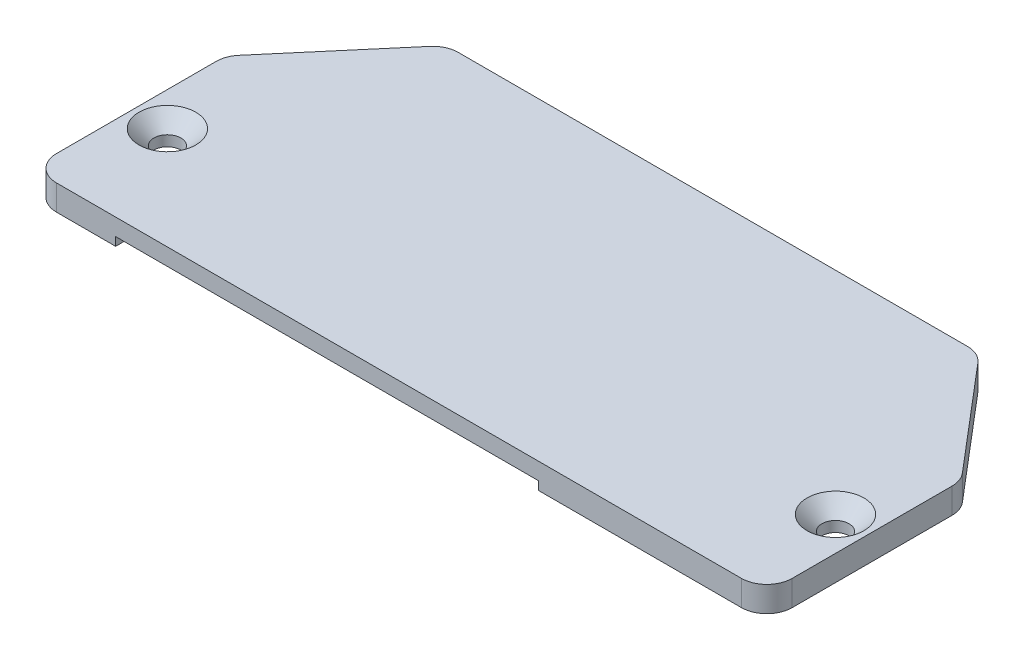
ISO-10303-21;
HEADER;
FILE_DESCRIPTION(('STEP AP214'),'2;1');
FILE_NAME('part.step','',(''),(''),'','','');
FILE_SCHEMA(('AUTOMOTIVE_DESIGN { 1 0 10303 214 1 1 1 1 }'));
ENDSEC;
DATA;
#1=APPLICATION_CONTEXT('core data for automotive mechanical design processes');
#2=APPLICATION_PROTOCOL_DEFINITION('international standard','automotive_design',2000,#1);
#3=PRODUCT_CONTEXT('',#1,'mechanical');
#4=PRODUCT('Part','Part','',(#3));
#5=PRODUCT_RELATED_PRODUCT_CATEGORY('part','',(#4));
#6=PRODUCT_DEFINITION_FORMATION('','',#4);
#7=PRODUCT_DEFINITION_CONTEXT('part definition',#1,'design');
#8=PRODUCT_DEFINITION('design','',#6,#7);
#9=PRODUCT_DEFINITION_SHAPE('','',#8);
#10=(LENGTH_UNIT() NAMED_UNIT(*) SI_UNIT(.MILLI.,.METRE.));
#11=(NAMED_UNIT(*) PLANE_ANGLE_UNIT() SI_UNIT($,.RADIAN.));
#12=(NAMED_UNIT(*) SI_UNIT($,.STERADIAN.) SOLID_ANGLE_UNIT());
#13=UNCERTAINTY_MEASURE_WITH_UNIT(LENGTH_MEASURE(1.E-05),#10,'distance_accuracy_value','');
#14=(GEOMETRIC_REPRESENTATION_CONTEXT(3) GLOBAL_UNCERTAINTY_ASSIGNED_CONTEXT((#13)) GLOBAL_UNIT_ASSIGNED_CONTEXT((#10,
#11,#12)) REPRESENTATION_CONTEXT('',''));
#15=CARTESIAN_POINT('',(0.,0.,0.));
#16=DIRECTION('',(0.,0.,1.));
#17=DIRECTION('',(1.,0.,0.));
#18=AXIS2_PLACEMENT_3D('',#15,#16,#17);
#19=CARTESIAN_POINT('',(0.,0.,0.));
#20=DIRECTION('',(0.,-1.,0.));
#21=DIRECTION('',(0.,0.,-1.));
#22=AXIS2_PLACEMENT_3D('',#19,#20,#21);
#23=PLANE('',#22);
#24=CARTESIAN_POINT('',(57.,0.,-18.));
#25=DIRECTION('',(0.,-1.,0.));
#26=DIRECTION('',(0.,0.,-1.));
#27=AXIS2_PLACEMENT_3D('',#24,#25,#26);
#28=CIRCLE('',#27,2.);
#29=CARTESIAN_POINT('',(57.,0.,-20.));
#30=VERTEX_POINT('',#29);
#31=EDGE_CURVE('E19',#30,#30,#28,.F.);
#32=ORIENTED_EDGE('',*,*,#31,.F.);
#33=EDGE_LOOP('',(#32));
#34=FACE_BOUND('',#33,.T.);
#35=ADVANCED_FACE('F16',(#34),#23,.T.);
#36=CARTESIAN_POINT('',(0.,0.,0.));
#37=DIRECTION('',(0.,-1.,0.));
#38=DIRECTION('',(0.,0.,-1.));
#39=AXIS2_PLACEMENT_3D('',#36,#37,#38);
#40=PLANE('',#39);
#41=CARTESIAN_POINT('',(72.,0.,-18.));
#42=DIRECTION('',(0.,-1.,0.));
#43=DIRECTION('',(0.,0.,-1.));
#44=AXIS2_PLACEMENT_3D('',#41,#42,#43);
#45=CIRCLE('',#44,2.);
#46=CARTESIAN_POINT('',(72.,0.,-20.));
#47=VERTEX_POINT('',#46);
#48=EDGE_CURVE('E458',#47,#47,#45,.F.);
#49=ORIENTED_EDGE('',*,*,#48,.F.);
#50=EDGE_LOOP('',(#49));
#51=FACE_BOUND('',#50,.T.);
#52=ADVANCED_FACE('F469',(#51),#40,.T.);
#53=CARTESIAN_POINT('',(0.,0.,0.));
#54=DIRECTION('',(0.,-1.,0.));
#55=DIRECTION('',(0.,0.,-1.));
#56=AXIS2_PLACEMENT_3D('',#53,#54,#55);
#57=PLANE('',#56);
#58=CARTESIAN_POINT('',(17.8,0.,-19.2));
#59=DIRECTION('',(0.,-1.,0.));
#60=DIRECTION('',(0.,0.,-1.));
#61=AXIS2_PLACEMENT_3D('',#58,#59,#60);
#62=CIRCLE('',#61,2.);
#63=CARTESIAN_POINT('',(17.8,0.,-21.2));
#64=VERTEX_POINT('',#63);
#65=EDGE_CURVE('E456',#64,#64,#62,.F.);
#66=ORIENTED_EDGE('',*,*,#65,.F.);
#67=EDGE_LOOP('',(#66));
#68=FACE_BOUND('',#67,.T.);
#69=ADVANCED_FACE('F474',(#68),#57,.T.);
#70=CARTESIAN_POINT('',(0.,0.,0.));
#71=DIRECTION('',(0.,-1.,0.));
#72=DIRECTION('',(0.,0.,-1.));
#73=AXIS2_PLACEMENT_3D('',#70,#71,#72);
#74=PLANE('',#73);
#75=CARTESIAN_POINT('',(35.,0.,-14.2));
#76=DIRECTION('',(0.,-1.,0.));
#77=DIRECTION('',(0.,0.,-1.));
#78=AXIS2_PLACEMENT_3D('',#75,#76,#77);
#79=CIRCLE('',#78,2.);
#80=CARTESIAN_POINT('',(35.,0.,-16.2));
#81=VERTEX_POINT('',#80);
#82=EDGE_CURVE('E453',#81,#81,#79,.F.);
#83=ORIENTED_EDGE('',*,*,#82,.F.);
#84=EDGE_LOOP('',(#83));
#85=FACE_BOUND('',#84,.T.);
#86=ADVANCED_FACE('F663',(#85),#74,.T.);
#87=CARTESIAN_POINT('',(57.,0.,-18.));
#88=DIRECTION('',(0.,-1.,0.));
#89=DIRECTION('',(0.,0.,-1.));
#90=AXIS2_PLACEMENT_3D('',#87,#88,#89);
#91=CYLINDRICAL_SURFACE('',#90,2.);
#92=ORIENTED_EDGE('',*,*,#31,.T.);
#93=EDGE_LOOP('',(#92));
#94=FACE_BOUND('',#93,.T.);
#95=CARTESIAN_POINT('',(57.,1.5,-18.));
#96=DIRECTION('',(0.,-1.,0.));
#97=DIRECTION('',(0.,0.,-1.));
#98=AXIS2_PLACEMENT_3D('',#95,#96,#97);
#99=CIRCLE('',#98,2.);
#100=CARTESIAN_POINT('',(57.,1.5,-20.));
#101=VERTEX_POINT('',#100);
#102=EDGE_CURVE('E450',#101,#101,#99,.F.);
#103=ORIENTED_EDGE('',*,*,#102,.F.);
#104=EDGE_LOOP('',(#103));
#105=FACE_BOUND('',#104,.T.);
#106=ADVANCED_FACE('F465',(#94,#105),#91,.T.);
#107=CARTESIAN_POINT('',(72.,0.,-18.));
#108=DIRECTION('',(0.,-1.,0.));
#109=DIRECTION('',(0.,0.,-1.));
#110=AXIS2_PLACEMENT_3D('',#107,#108,#109);
#111=CYLINDRICAL_SURFACE('',#110,2.);
#112=ORIENTED_EDGE('',*,*,#48,.T.);
#113=EDGE_LOOP('',(#112));
#114=FACE_BOUND('',#113,.T.);
#115=CARTESIAN_POINT('',(72.,1.5,-18.));
#116=DIRECTION('',(0.,-1.,0.));
#117=DIRECTION('',(0.,0.,-1.));
#118=AXIS2_PLACEMENT_3D('',#115,#116,#117);
#119=CIRCLE('',#118,2.);
#120=CARTESIAN_POINT('',(72.,1.5,-20.));
#121=VERTEX_POINT('',#120);
#122=EDGE_CURVE('E447',#121,#121,#119,.F.);
#123=ORIENTED_EDGE('',*,*,#122,.F.);
#124=EDGE_LOOP('',(#123));
#125=FACE_BOUND('',#124,.T.);
#126=ADVANCED_FACE('F657',(#114,#125),#111,.T.);
#127=CARTESIAN_POINT('',(17.8,0.,-19.2));
#128=DIRECTION('',(0.,-1.,0.));
#129=DIRECTION('',(0.,0.,-1.));
#130=AXIS2_PLACEMENT_3D('',#127,#128,#129);
#131=CYLINDRICAL_SURFACE('',#130,2.);
#132=ORIENTED_EDGE('',*,*,#65,.T.);
#133=EDGE_LOOP('',(#132));
#134=FACE_BOUND('',#133,.T.);
#135=CARTESIAN_POINT('',(17.8,1.5,-19.2));
#136=DIRECTION('',(0.,-1.,0.));
#137=DIRECTION('',(0.,0.,-1.));
#138=AXIS2_PLACEMENT_3D('',#135,#136,#137);
#139=CIRCLE('',#138,2.);
#140=CARTESIAN_POINT('',(17.8,1.5,-21.2));
#141=VERTEX_POINT('',#140);
#142=EDGE_CURVE('E444',#141,#141,#139,.F.);
#143=ORIENTED_EDGE('',*,*,#142,.F.);
#144=EDGE_LOOP('',(#143));
#145=FACE_BOUND('',#144,.T.);
#146=ADVANCED_FACE('F653',(#134,#145),#131,.T.);
#147=CARTESIAN_POINT('',(35.,0.,-14.2));
#148=DIRECTION('',(0.,-1.,0.));
#149=DIRECTION('',(0.,0.,-1.));
#150=AXIS2_PLACEMENT_3D('',#147,#148,#149);
#151=CYLINDRICAL_SURFACE('',#150,2.);
#152=ORIENTED_EDGE('',*,*,#82,.T.);
#153=EDGE_LOOP('',(#152));
#154=FACE_BOUND('',#153,.T.);
#155=CARTESIAN_POINT('',(35.,1.5,-14.2));
#156=DIRECTION('',(0.,-1.,0.));
#157=DIRECTION('',(0.,0.,-1.));
#158=AXIS2_PLACEMENT_3D('',#155,#156,#157);
#159=CIRCLE('',#158,2.);
#160=CARTESIAN_POINT('',(35.,1.5,-16.2));
#161=VERTEX_POINT('',#160);
#162=EDGE_CURVE('E285',#161,#161,#159,.F.);
#163=ORIENTED_EDGE('',*,*,#162,.F.);
#164=EDGE_LOOP('',(#163));
#165=FACE_BOUND('',#164,.T.);
#166=ADVANCED_FACE('F649',(#154,#165),#151,.T.);
#167=CARTESIAN_POINT('',(0.,1.5,0.));
#168=DIRECTION('',(0.,-1.,0.));
#169=DIRECTION('',(0.,0.,-1.));
#170=AXIS2_PLACEMENT_3D('',#167,#168,#169);
#171=PLANE('',#170);
#172=ORIENTED_EDGE('',*,*,#162,.T.);
#173=EDGE_LOOP('',(#172));
#174=FACE_BOUND('',#173,.T.);
#175=ORIENTED_EDGE('',*,*,#142,.T.);
#176=EDGE_LOOP('',(#175));
#177=FACE_BOUND('',#176,.T.);
#178=ORIENTED_EDGE('',*,*,#122,.T.);
#179=EDGE_LOOP('',(#178));
#180=FACE_BOUND('',#179,.T.);
#181=ORIENTED_EDGE('',*,*,#102,.T.);
#182=EDGE_LOOP('',(#181));
#183=FACE_BOUND('',#182,.T.);
#184=DIRECTION('',(-0.647585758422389,0.,0.761992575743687));
#185=VECTOR('',#184,1.);
#186=CARTESIAN_POINT('',(2.5,1.5,-23.62537113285));
#187=LINE('',#186,#185);
#188=CARTESIAN_POINT('',(2.97601484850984,1.5,-24.1854819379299));
#189=VERTEX_POINT('',#188);
#190=CARTESIAN_POINT('',(11.8397736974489,1.5,-34.6151715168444));
#191=VERTEX_POINT('',#190);
#192=EDGE_CURVE('E307',#189,#191,#187,.F.);
#193=ORIENTED_EDGE('',*,*,#192,.T.);
#194=CARTESIAN_POINT('',(13.36375884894,1.5,-33.32));
#195=DIRECTION('',(0.,1.,0.));
#196=DIRECTION('',(0.,0.,1.));
#197=AXIS2_PLACEMENT_3D('',#194,#195,#196);
#198=CIRCLE('',#197,2.);
#199=CARTESIAN_POINT('',(13.36375884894,1.5,-35.32));
#200=VERTEX_POINT('',#199);
#201=EDGE_CURVE('E309',#191,#200,#198,.F.);
#202=ORIENTED_EDGE('',*,*,#201,.T.);
#203=DIRECTION('',(-1.,0.,0.));
#204=VECTOR('',#203,1.);
#205=CARTESIAN_POINT('',(12.43877807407,1.5,-35.32));
#206=LINE('',#205,#204);
#207=CARTESIAN_POINT('',(73.63624115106,1.5,-35.32));
#208=VERTEX_POINT('',#207);
#209=EDGE_CURVE('E303',#200,#208,#206,.F.);
#210=ORIENTED_EDGE('',*,*,#209,.T.);
#211=CARTESIAN_POINT('',(73.63624115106,1.5,-33.32));
#212=DIRECTION('',(0.,1.,0.));
#213=DIRECTION('',(0.,0.,1.));
#214=AXIS2_PLACEMENT_3D('',#211,#212,#213);
#215=CIRCLE('',#214,2.);
#216=CARTESIAN_POINT('',(75.1602263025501,1.5,-34.6151715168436));
#217=VERTEX_POINT('',#216);
#218=EDGE_CURVE('E305',#208,#217,#215,.F.);
#219=ORIENTED_EDGE('',*,*,#218,.T.);
#220=DIRECTION('',(-0.647585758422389,0.,-0.761992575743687));
#221=VECTOR('',#220,1.);
#222=CARTESIAN_POINT('',(74.56122192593,1.5,-35.32));
#223=LINE('',#222,#221);
#224=CARTESIAN_POINT('',(84.0239851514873,1.5,-24.1854819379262));
#225=VERTEX_POINT('',#224);
#226=EDGE_CURVE('E299',#217,#225,#223,.F.);
#227=ORIENTED_EDGE('',*,*,#226,.T.);
#228=CARTESIAN_POINT('',(82.5,1.5,-22.89031042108));
#229=DIRECTION('',(0.,1.,0.));
#230=DIRECTION('',(0.,0.,1.));
#231=AXIS2_PLACEMENT_3D('',#228,#229,#230);
#232=CIRCLE('',#231,2.);
#233=CARTESIAN_POINT('',(84.5,1.5,-22.89031042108));
#234=VERTEX_POINT('',#233);
#235=EDGE_CURVE('E301',#225,#234,#232,.F.);
#236=ORIENTED_EDGE('',*,*,#235,.T.);
#237=DIRECTION('',(0.,0.,-1.));
#238=VECTOR('',#237,1.);
#239=CARTESIAN_POINT('',(84.5,1.5,-23.62537113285));
#240=LINE('',#239,#238);
#241=CARTESIAN_POINT('',(84.5,1.5,-17.59722557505));
#242=VERTEX_POINT('',#241);
#243=EDGE_CURVE('E295',#234,#242,#240,.F.);
#244=ORIENTED_EDGE('',*,*,#243,.T.);
#245=CARTESIAN_POINT('',(82.5,1.5,-17.59722557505));
#246=DIRECTION('',(0.,1.,0.));
#247=DIRECTION('',(0.,0.,1.));
#248=AXIS2_PLACEMENT_3D('',#245,#246,#247);
#249=CIRCLE('',#248,2.);
#250=CARTESIAN_POINT('',(82.6818181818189,1.5,-15.605507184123));
#251=VERTEX_POINT('',#250);
#252=EDGE_CURVE('E297',#242,#251,#249,.F.);
#253=ORIENTED_EDGE('',*,*,#252,.T.);
#254=CARTESIAN_POINT('',(83.,1.5,-12.12));
#255=DIRECTION('',(0.,-1.,0.));
#256=DIRECTION('',(0.,0.,-1.));
#257=AXIS2_PLACEMENT_3D('',#254,#255,#256);
#258=CIRCLE('',#257,3.5);
#259=CARTESIAN_POINT('',(82.6818181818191,1.5,-8.63449281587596));
#260=VERTEX_POINT('',#259);
#261=EDGE_CURVE('E420',#260,#251,#258,.T.);
#262=ORIENTED_EDGE('',*,*,#261,.F.);
#263=CARTESIAN_POINT('',(82.5,1.5,-6.642774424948));
#264=DIRECTION('',(0.,1.,0.));
#265=DIRECTION('',(0.,0.,1.));
#266=AXIS2_PLACEMENT_3D('',#263,#264,#265);
#267=CIRCLE('',#266,2.);
#268=CARTESIAN_POINT('',(84.5,1.5,-6.642774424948));
#269=VERTEX_POINT('',#268);
#270=EDGE_CURVE('E416',#260,#269,#267,.F.);
#271=ORIENTED_EDGE('',*,*,#270,.T.);
#272=DIRECTION('',(0.,0.,-1.));
#273=VECTOR('',#272,1.);
#274=CARTESIAN_POINT('',(84.5,1.5,-8.957722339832));
#275=LINE('',#274,#273);
#276=CARTESIAN_POINT('',(84.5,1.5,-3.5));
#277=VERTEX_POINT('',#276);
#278=EDGE_CURVE('E292',#269,#277,#275,.F.);
#279=ORIENTED_EDGE('',*,*,#278,.T.);
#280=CARTESIAN_POINT('',(82.5,1.5,-3.5));
#281=DIRECTION('',(0.,1.,0.));
#282=DIRECTION('',(0.,0.,1.));
#283=AXIS2_PLACEMENT_3D('',#280,#281,#282);
#284=CIRCLE('',#283,2.);
#285=CARTESIAN_POINT('',(82.5,1.5,-1.5));
#286=VERTEX_POINT('',#285);
#287=EDGE_CURVE('E257',#277,#286,#284,.F.);
#288=ORIENTED_EDGE('',*,*,#287,.T.);
#289=DIRECTION('',(1.,0.,0.));
#290=VECTOR('',#289,1.);
#291=CARTESIAN_POINT('',(84.5,1.5,-1.5));
#292=LINE('',#291,#290);
#293=CARTESIAN_POINT('',(4.5,1.5,-1.5));
#294=VERTEX_POINT('',#293);
#295=EDGE_CURVE('E254',#286,#294,#292,.F.);
#296=ORIENTED_EDGE('',*,*,#295,.T.);
#297=CARTESIAN_POINT('',(4.5,1.5,-3.5));
#298=DIRECTION('',(0.,1.,0.));
#299=DIRECTION('',(0.,0.,1.));
#300=AXIS2_PLACEMENT_3D('',#297,#298,#299);
#301=CIRCLE('',#300,2.);
#302=CARTESIAN_POINT('',(2.5,1.5,-3.5));
#303=VERTEX_POINT('',#302);
#304=EDGE_CURVE('E241',#294,#303,#301,.F.);
#305=ORIENTED_EDGE('',*,*,#304,.T.);
#306=DIRECTION('',(0.,0.,1.));
#307=VECTOR('',#306,1.);
#308=CARTESIAN_POINT('',(2.5,1.5,-1.5));
#309=LINE('',#308,#307);
#310=CARTESIAN_POINT('',(2.5,1.5,-6.642774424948));
#311=VERTEX_POINT('',#310);
#312=EDGE_CURVE('E315',#303,#311,#309,.F.);
#313=ORIENTED_EDGE('',*,*,#312,.T.);
#314=CARTESIAN_POINT('',(4.5,1.5,-6.642774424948));
#315=DIRECTION('',(0.,1.,0.));
#316=DIRECTION('',(0.,0.,1.));
#317=AXIS2_PLACEMENT_3D('',#314,#315,#316);
#318=CIRCLE('',#317,2.);
#319=CARTESIAN_POINT('',(4.31818181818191,1.5,-8.63449281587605));
#320=VERTEX_POINT('',#319);
#321=EDGE_CURVE('E316',#311,#320,#318,.F.);
#322=ORIENTED_EDGE('',*,*,#321,.T.);
#323=CARTESIAN_POINT('',(4.,1.5,-12.12));
#324=DIRECTION('',(0.,-1.,0.));
#325=DIRECTION('',(0.,0.,-1.));
#326=AXIS2_PLACEMENT_3D('',#323,#324,#325);
#327=CIRCLE('',#326,3.5);
#328=CARTESIAN_POINT('',(4.31818181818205,1.5,-15.6055071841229));
#329=VERTEX_POINT('',#328);
#330=EDGE_CURVE('E437',#329,#320,#327,.T.);
#331=ORIENTED_EDGE('',*,*,#330,.F.);
#332=CARTESIAN_POINT('',(4.5,1.5,-17.59722557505));
#333=DIRECTION('',(0.,1.,0.));
#334=DIRECTION('',(0.,0.,1.));
#335=AXIS2_PLACEMENT_3D('',#332,#333,#334);
#336=CIRCLE('',#335,2.);
#337=CARTESIAN_POINT('',(2.5,1.5,-17.59722557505));
#338=VERTEX_POINT('',#337);
#339=EDGE_CURVE('E433',#329,#338,#336,.F.);
#340=ORIENTED_EDGE('',*,*,#339,.T.);
#341=DIRECTION('',(0.,0.,1.));
#342=VECTOR('',#341,1.);
#343=CARTESIAN_POINT('',(2.5,1.5,-15.28227766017));
#344=LINE('',#343,#342);
#345=CARTESIAN_POINT('',(2.5,1.5,-22.89031042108));
#346=VERTEX_POINT('',#345);
#347=EDGE_CURVE('E311',#338,#346,#344,.F.);
#348=ORIENTED_EDGE('',*,*,#347,.T.);
#349=CARTESIAN_POINT('',(4.5,1.5,-22.89031042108));
#350=DIRECTION('',(0.,1.,0.));
#351=DIRECTION('',(0.,0.,1.));
#352=AXIS2_PLACEMENT_3D('',#349,#350,#351);
#353=CIRCLE('',#352,2.);
#354=EDGE_CURVE('E313',#346,#189,#353,.F.);
#355=ORIENTED_EDGE('',*,*,#354,.T.);
#356=EDGE_LOOP('',(#193,#202,#210,#219,#227,#236,#244,#253,#262,#271,#279,#288,#296,#305,#313,
#322,#331,#340,#348,#355));
#357=FACE_BOUND('',#356,.T.);
#358=ADVANCED_FACE('F255',(#174,#177,#180,#183,#357),#171,.T.);
#359=CARTESIAN_POINT('',(4.5,0.,-28.65));
#360=DIRECTION('',(0.,1.,0.));
#361=DIRECTION('',(0.,0.,1.));
#362=AXIS2_PLACEMENT_3D('',#359,#360,#361);
#363=CYLINDRICAL_SURFACE('',#362,1.1);
#364=CARTESIAN_POINT('',(4.5,1.,-28.65));
#365=DIRECTION('',(0.,1.,0.));
#366=DIRECTION('',(0.,0.,1.));
#367=AXIS2_PLACEMENT_3D('',#364,#365,#366);
#368=CIRCLE('',#367,1.1);
#369=CARTESIAN_POINT('',(3.97856307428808,1.,-27.6814425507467));
#370=VERTEX_POINT('',#369);
#371=CARTESIAN_POINT('',(5.3717903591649,1.,-29.3208066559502));
#372=VERTEX_POINT('',#371);
#373=EDGE_CURVE('E261',#370,#372,#368,.T.);
#374=ORIENTED_EDGE('',*,*,#373,.T.);
#375=DIRECTION('',(0.,1.,0.));
#376=VECTOR('',#375,1.);
#377=CARTESIAN_POINT('',(5.37179035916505,0.,-29.32080665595));
#378=LINE('',#377,#376);
#379=CARTESIAN_POINT('',(5.3717903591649,0.,-29.3208066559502));
#380=VERTEX_POINT('',#379);
#381=EDGE_CURVE('E283',#380,#372,#378,.T.);
#382=ORIENTED_EDGE('',*,*,#381,.F.);
#383=CARTESIAN_POINT('',(4.5,0.,-28.65));
#384=DIRECTION('',(0.,1.,0.));
#385=DIRECTION('',(0.,0.,1.));
#386=AXIS2_PLACEMENT_3D('',#383,#384,#385);
#387=CIRCLE('',#386,1.1);
#388=CARTESIAN_POINT('',(3.97856307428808,0.,-27.6814425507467));
#389=VERTEX_POINT('',#388);
#390=EDGE_CURVE('E408',#380,#389,#387,.F.);
#391=ORIENTED_EDGE('',*,*,#390,.T.);
#392=DIRECTION('',(0.,1.,0.));
#393=VECTOR('',#392,1.);
#394=CARTESIAN_POINT('',(3.97856307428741,0.,-27.681442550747));
#395=LINE('',#394,#393);
#396=EDGE_CURVE('E251',#370,#389,#395,.F.);
#397=ORIENTED_EDGE('',*,*,#396,.F.);
#398=EDGE_LOOP('',(#374,#382,#391,#397));
#399=FACE_BOUND('',#398,.T.);
#400=ADVANCED_FACE('F643',(#399),#363,.F.);
#401=CARTESIAN_POINT('',(4.5,-3.9108,-3.5));
#402=DIRECTION('',(0.,1.,0.));
#403=DIRECTION('',(0.,0.,1.));
#404=AXIS2_PLACEMENT_3D('',#401,#402,#403);
#405=CYLINDRICAL_SURFACE('',#404,2.);
#406=CARTESIAN_POINT('',(4.5,0.,-3.5));
#407=DIRECTION('',(0.,1.,0.));
#408=DIRECTION('',(0.,0.,1.));
#409=AXIS2_PLACEMENT_3D('',#406,#407,#408);
#410=CIRCLE('',#409,2.);
#411=CARTESIAN_POINT('',(4.5,0.,-1.5));
#412=VERTEX_POINT('',#411);
#413=CARTESIAN_POINT('',(2.5,0.,-3.5));
#414=VERTEX_POINT('',#413);
#415=EDGE_CURVE('E406',#412,#414,#410,.F.);
#416=ORIENTED_EDGE('',*,*,#415,.T.);
#417=DIRECTION('',(0.,1.,0.));
#418=VECTOR('',#417,1.);
#419=CARTESIAN_POINT('',(2.5,0.,-3.5));
#420=LINE('',#419,#418);
#421=EDGE_CURVE('E248',#414,#303,#420,.T.);
#422=ORIENTED_EDGE('',*,*,#421,.T.);
#423=ORIENTED_EDGE('',*,*,#304,.F.);
#424=DIRECTION('',(0.,1.,0.));
#425=VECTOR('',#424,1.);
#426=CARTESIAN_POINT('',(4.5,0.,-1.5));
#427=LINE('',#426,#425);
#428=EDGE_CURVE('E245',#294,#412,#427,.F.);
#429=ORIENTED_EDGE('',*,*,#428,.T.);
#430=EDGE_LOOP('',(#416,#422,#423,#429));
#431=FACE_BOUND('',#430,.T.);
#432=ADVANCED_FACE('F243',(#431),#405,.F.);
#433=CARTESIAN_POINT('',(2.5,0.,-1.5));
#434=DIRECTION('',(-1.,0.,0.));
#435=DIRECTION('',(0.,0.,1.));
#436=AXIS2_PLACEMENT_3D('',#433,#434,#435);
#437=PLANE('',#436);
#438=ORIENTED_EDGE('',*,*,#421,.F.);
#439=DIRECTION('',(0.,0.,1.));
#440=VECTOR('',#439,1.);
#441=CARTESIAN_POINT('',(2.5,0.,0.));
#442=LINE('',#441,#440);
#443=CARTESIAN_POINT('',(2.5,0.,-6.642774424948));
#444=VERTEX_POINT('',#443);
#445=EDGE_CURVE('E405',#414,#444,#442,.F.);
#446=ORIENTED_EDGE('',*,*,#445,.T.);
#447=DIRECTION('',(0.,1.,0.));
#448=VECTOR('',#447,1.);
#449=CARTESIAN_POINT('',(2.5,-3.9108,-6.642774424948));
#450=LINE('',#449,#448);
#451=EDGE_CURVE('E440',#444,#311,#450,.T.);
#452=ORIENTED_EDGE('',*,*,#451,.T.);
#453=ORIENTED_EDGE('',*,*,#312,.F.);
#454=EDGE_LOOP('',(#438,#446,#452,#453));
#455=FACE_BOUND('',#454,.T.);
#456=ADVANCED_FACE('F636',(#455),#437,.F.);
#457=CARTESIAN_POINT('',(4.5,-3.9108,-6.642774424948));
#458=DIRECTION('',(0.,1.,0.));
#459=DIRECTION('',(0.,0.,1.));
#460=AXIS2_PLACEMENT_3D('',#457,#458,#459);
#461=CYLINDRICAL_SURFACE('',#460,2.);
#462=CARTESIAN_POINT('',(4.5,0.,-6.642774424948));
#463=DIRECTION('',(0.,1.,0.));
#464=DIRECTION('',(0.,0.,1.));
#465=AXIS2_PLACEMENT_3D('',#462,#463,#464);
#466=CIRCLE('',#465,2.);
#467=CARTESIAN_POINT('',(4.31818181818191,0.,-8.63449281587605));
#468=VERTEX_POINT('',#467);
#469=EDGE_CURVE('E403',#444,#468,#466,.F.);
#470=ORIENTED_EDGE('',*,*,#469,.T.);
#471=DIRECTION('',(0.,-1.,0.));
#472=VECTOR('',#471,1.);
#473=CARTESIAN_POINT('',(4.31818181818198,0.,-8.63449281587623));
#474=LINE('',#473,#472);
#475=EDGE_CURVE('E436',#320,#468,#474,.T.);
#476=ORIENTED_EDGE('',*,*,#475,.F.);
#477=ORIENTED_EDGE('',*,*,#321,.F.);
#478=ORIENTED_EDGE('',*,*,#451,.F.);
#479=EDGE_LOOP('',(#470,#476,#477,#478));
#480=FACE_BOUND('',#479,.T.);
#481=ADVANCED_FACE('F632',(#480),#461,.F.);
#482=CARTESIAN_POINT('',(4.,0.,-12.12));
#483=DIRECTION('',(0.,-1.,0.));
#484=DIRECTION('',(0.,0.,-1.));
#485=AXIS2_PLACEMENT_3D('',#482,#483,#484);
#486=CYLINDRICAL_SURFACE('',#485,3.5);
#487=CARTESIAN_POINT('',(4.,0.,-12.12));
#488=DIRECTION('',(0.,-1.,0.));
#489=DIRECTION('',(0.,0.,-1.));
#490=AXIS2_PLACEMENT_3D('',#487,#488,#489);
#491=CIRCLE('',#490,3.5);
#492=CARTESIAN_POINT('',(4.31818181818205,0.,-15.6055071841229));
#493=VERTEX_POINT('',#492);
#494=EDGE_CURVE('E401',#468,#493,#491,.F.);
#495=ORIENTED_EDGE('',*,*,#494,.T.);
#496=DIRECTION('',(0.,1.,0.));
#497=VECTOR('',#496,1.);
#498=CARTESIAN_POINT('',(4.31818181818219,-3.9108,-15.6055071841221));
#499=LINE('',#498,#497);
#500=EDGE_CURVE('E435',#493,#329,#499,.T.);
#501=ORIENTED_EDGE('',*,*,#500,.T.);
#502=ORIENTED_EDGE('',*,*,#330,.T.);
#503=ORIENTED_EDGE('',*,*,#475,.T.);
#504=EDGE_LOOP('',(#495,#501,#502,#503));
#505=FACE_BOUND('',#504,.T.);
#506=ADVANCED_FACE('F628',(#505),#486,.T.);
#507=CARTESIAN_POINT('',(4.5,-3.9108,-17.59722557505));
#508=DIRECTION('',(0.,1.,0.));
#509=DIRECTION('',(0.,0.,1.));
#510=AXIS2_PLACEMENT_3D('',#507,#508,#509);
#511=CYLINDRICAL_SURFACE('',#510,2.);
#512=CARTESIAN_POINT('',(4.5,0.,-17.59722557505));
#513=DIRECTION('',(0.,1.,0.));
#514=DIRECTION('',(0.,0.,1.));
#515=AXIS2_PLACEMENT_3D('',#512,#513,#514);
#516=CIRCLE('',#515,2.);
#517=CARTESIAN_POINT('',(2.5,0.,-17.59722557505));
#518=VERTEX_POINT('',#517);
#519=EDGE_CURVE('E399',#493,#518,#516,.F.);
#520=ORIENTED_EDGE('',*,*,#519,.T.);
#521=DIRECTION('',(0.,1.,0.));
#522=VECTOR('',#521,1.);
#523=CARTESIAN_POINT('',(2.5,0.,-17.59722557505));
#524=LINE('',#523,#522);
#525=EDGE_CURVE('E314',#518,#338,#524,.T.);
#526=ORIENTED_EDGE('',*,*,#525,.T.);
#527=ORIENTED_EDGE('',*,*,#339,.F.);
#528=ORIENTED_EDGE('',*,*,#500,.F.);
#529=EDGE_LOOP('',(#520,#526,#527,#528));
#530=FACE_BOUND('',#529,.T.);
#531=ADVANCED_FACE('F624',(#530),#511,.F.);
#532=CARTESIAN_POINT('',(2.5,0.,-15.28227766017));
#533=DIRECTION('',(-1.,0.,0.));
#534=DIRECTION('',(0.,0.,1.));
#535=AXIS2_PLACEMENT_3D('',#532,#533,#534);
#536=PLANE('',#535);
#537=ORIENTED_EDGE('',*,*,#525,.F.);
#538=DIRECTION('',(0.,0.,1.));
#539=VECTOR('',#538,1.);
#540=CARTESIAN_POINT('',(2.5,0.,0.));
#541=LINE('',#540,#539);
#542=CARTESIAN_POINT('',(2.5,0.,-22.89031042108));
#543=VERTEX_POINT('',#542);
#544=EDGE_CURVE('E398',#518,#543,#541,.F.);
#545=ORIENTED_EDGE('',*,*,#544,.T.);
#546=DIRECTION('',(0.,1.,0.));
#547=VECTOR('',#546,1.);
#548=CARTESIAN_POINT('',(2.5,-3.9108,-22.89031042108));
#549=LINE('',#548,#547);
#550=EDGE_CURVE('E432',#543,#346,#549,.T.);
#551=ORIENTED_EDGE('',*,*,#550,.T.);
#552=ORIENTED_EDGE('',*,*,#347,.F.);
#553=EDGE_LOOP('',(#537,#545,#551,#552));
#554=FACE_BOUND('',#553,.T.);
#555=ADVANCED_FACE('F620',(#554),#536,.F.);
#556=CARTESIAN_POINT('',(4.5,-3.9108,-22.89031042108));
#557=DIRECTION('',(0.,1.,0.));
#558=DIRECTION('',(0.,0.,1.));
#559=AXIS2_PLACEMENT_3D('',#556,#557,#558);
#560=CYLINDRICAL_SURFACE('',#559,2.);
#561=CARTESIAN_POINT('',(4.5,0.,-22.89031042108));
#562=DIRECTION('',(0.,1.,0.));
#563=DIRECTION('',(0.,0.,1.));
#564=AXIS2_PLACEMENT_3D('',#561,#562,#563);
#565=CIRCLE('',#564,2.);
#566=CARTESIAN_POINT('',(2.97601484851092,0.,-24.1854819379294));
#567=VERTEX_POINT('',#566);
#568=EDGE_CURVE('E396',#543,#567,#565,.F.);
#569=ORIENTED_EDGE('',*,*,#568,.T.);
#570=DIRECTION('',(0.,1.,0.));
#571=VECTOR('',#570,1.);
#572=CARTESIAN_POINT('',(2.97601484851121,0.,-24.1854819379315));
#573=LINE('',#572,#571);
#574=EDGE_CURVE('E310',#567,#189,#573,.T.);
#575=ORIENTED_EDGE('',*,*,#574,.T.);
#576=ORIENTED_EDGE('',*,*,#354,.F.);
#577=ORIENTED_EDGE('',*,*,#550,.F.);
#578=EDGE_LOOP('',(#569,#575,#576,#577));
#579=FACE_BOUND('',#578,.T.);
#580=ADVANCED_FACE('F616',(#579),#560,.F.);
#581=CARTESIAN_POINT('',(2.5,0.,-23.62537113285));
#582=DIRECTION('',(-0.761992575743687,0.,-0.647585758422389));
#583=DIRECTION('',(-0.647585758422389,0.,0.761992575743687));
#584=AXIS2_PLACEMENT_3D('',#581,#582,#583);
#585=PLANE('',#584);
#586=ORIENTED_EDGE('',*,*,#574,.F.);
#587=DIRECTION('',(0.647585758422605,0.,-0.761992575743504));
#588=VECTOR('',#587,1.);
#589=CARTESIAN_POINT('',(2.976014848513,0.,-24.18548193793));
#590=LINE('',#589,#588);
#591=CARTESIAN_POINT('',(11.8397736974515,0.,-34.6151715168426));
#592=VERTEX_POINT('',#591);
#593=EDGE_CURVE('E395',#567,#592,#590,.T.);
#594=ORIENTED_EDGE('',*,*,#593,.T.);
#595=DIRECTION('',(0.,1.,0.));
#596=VECTOR('',#595,1.);
#597=CARTESIAN_POINT('',(11.8397736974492,-3.9108,-34.6151715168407));
#598=LINE('',#597,#596);
#599=EDGE_CURVE('E430',#592,#191,#598,.T.);
#600=ORIENTED_EDGE('',*,*,#599,.T.);
#601=ORIENTED_EDGE('',*,*,#192,.F.);
#602=EDGE_LOOP('',(#586,#594,#600,#601));
#603=FACE_BOUND('',#602,.T.);
#604=ADVANCED_FACE('F612',(#603),#585,.F.);
#605=CARTESIAN_POINT('',(13.36375884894,-3.9108,-33.32));
#606=DIRECTION('',(0.,1.,0.));
#607=DIRECTION('',(0.,0.,1.));
#608=AXIS2_PLACEMENT_3D('',#605,#606,#607);
#609=CYLINDRICAL_SURFACE('',#608,2.);
#610=CARTESIAN_POINT('',(13.36375884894,0.,-33.32));
#611=DIRECTION('',(0.,1.,0.));
#612=DIRECTION('',(0.,0.,1.));
#613=AXIS2_PLACEMENT_3D('',#610,#611,#612);
#614=CIRCLE('',#613,2.);
#615=CARTESIAN_POINT('',(13.36375884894,0.,-35.32));
#616=VERTEX_POINT('',#615);
#617=EDGE_CURVE('E393',#592,#616,#614,.F.);
#618=ORIENTED_EDGE('',*,*,#617,.T.);
#619=DIRECTION('',(0.,1.,0.));
#620=VECTOR('',#619,1.);
#621=CARTESIAN_POINT('',(13.36375884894,0.,-35.32));
#622=LINE('',#621,#620);
#623=EDGE_CURVE('E306',#616,#200,#622,.T.);
#624=ORIENTED_EDGE('',*,*,#623,.T.);
#625=ORIENTED_EDGE('',*,*,#201,.F.);
#626=ORIENTED_EDGE('',*,*,#599,.F.);
#627=EDGE_LOOP('',(#618,#624,#625,#626));
#628=FACE_BOUND('',#627,.T.);
#629=ADVANCED_FACE('F608',(#628),#609,.F.);
#630=CARTESIAN_POINT('',(12.43877807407,0.,-35.32));
#631=DIRECTION('',(0.,0.,-1.));
#632=DIRECTION('',(-1.,0.,0.));
#633=AXIS2_PLACEMENT_3D('',#630,#631,#632);
#634=PLANE('',#633);
#635=DIRECTION('',(0.,1.,0.));
#636=VECTOR('',#635,1.);
#637=CARTESIAN_POINT('',(73.63624115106,-3.9108,-35.32));
#638=LINE('',#637,#636);
#639=CARTESIAN_POINT('',(73.63624115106,0.,-35.32));
#640=VERTEX_POINT('',#639);
#641=EDGE_CURVE('E428',#640,#208,#638,.T.);
#642=ORIENTED_EDGE('',*,*,#641,.T.);
#643=ORIENTED_EDGE('',*,*,#209,.F.);
#644=ORIENTED_EDGE('',*,*,#623,.F.);
#645=DIRECTION('',(1.,0.,0.));
#646=VECTOR('',#645,1.);
#647=CARTESIAN_POINT('',(0.,0.,-35.32));
#648=LINE('',#647,#646);
#649=EDGE_CURVE('E392',#616,#640,#648,.T.);
#650=ORIENTED_EDGE('',*,*,#649,.T.);
#651=EDGE_LOOP('',(#642,#643,#644,#650));
#652=FACE_BOUND('',#651,.T.);
#653=ADVANCED_FACE('F604',(#652),#634,.F.);
#654=CARTESIAN_POINT('',(73.63624115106,-3.9108,-33.32));
#655=DIRECTION('',(0.,1.,0.));
#656=DIRECTION('',(0.,0.,1.));
#657=AXIS2_PLACEMENT_3D('',#654,#655,#656);
#658=CYLINDRICAL_SURFACE('',#657,2.);
#659=CARTESIAN_POINT('',(73.63624115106,0.,-33.32));
#660=DIRECTION('',(0.,1.,0.));
#661=DIRECTION('',(0.,0.,1.));
#662=AXIS2_PLACEMENT_3D('',#659,#660,#661);
#663=CIRCLE('',#662,2.);
#664=CARTESIAN_POINT('',(75.1602263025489,0.,-34.6151715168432));
#665=VERTEX_POINT('',#664);
#666=EDGE_CURVE('E390',#640,#665,#663,.F.);
#667=ORIENTED_EDGE('',*,*,#666,.T.);
#668=DIRECTION('',(0.,1.,0.));
#669=VECTOR('',#668,1.);
#670=CARTESIAN_POINT('',(75.1602263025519,0.,-34.6151715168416));
#671=LINE('',#670,#669);
#672=EDGE_CURVE('E302',#665,#217,#671,.T.);
#673=ORIENTED_EDGE('',*,*,#672,.T.);
#674=ORIENTED_EDGE('',*,*,#218,.F.);
#675=ORIENTED_EDGE('',*,*,#641,.F.);
#676=EDGE_LOOP('',(#667,#673,#674,#675));
#677=FACE_BOUND('',#676,.T.);
#678=ADVANCED_FACE('F600',(#677),#658,.F.);
#679=CARTESIAN_POINT('',(74.56122192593,0.,-35.32));
#680=DIRECTION('',(0.761992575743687,0.,-0.647585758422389));
#681=DIRECTION('',(-0.647585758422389,0.,-0.761992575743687));
#682=AXIS2_PLACEMENT_3D('',#679,#680,#681);
#683=PLANE('',#682);
#684=DIRECTION('',(0.,1.,0.));
#685=VECTOR('',#684,1.);
#686=CARTESIAN_POINT('',(84.0239851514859,-3.9108,-24.1854819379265));
#687=LINE('',#686,#685);
#688=CARTESIAN_POINT('',(84.0239851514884,0.,-24.1854819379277));
#689=VERTEX_POINT('',#688);
#690=EDGE_CURVE('E426',#689,#225,#687,.T.);
#691=ORIENTED_EDGE('',*,*,#690,.T.);
#692=ORIENTED_EDGE('',*,*,#226,.F.);
#693=ORIENTED_EDGE('',*,*,#672,.F.);
#694=DIRECTION('',(0.647585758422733,0.,0.761992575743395));
#695=VECTOR('',#694,1.);
#696=CARTESIAN_POINT('',(75.16022630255,0.,-34.61517151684));
#697=LINE('',#696,#695);
#698=EDGE_CURVE('E389',#665,#689,#697,.T.);
#699=ORIENTED_EDGE('',*,*,#698,.T.);
#700=EDGE_LOOP('',(#691,#692,#693,#699));
#701=FACE_BOUND('',#700,.T.);
#702=ADVANCED_FACE('F596',(#701),#683,.F.);
#703=CARTESIAN_POINT('',(82.5,-3.9108,-22.89031042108));
#704=DIRECTION('',(0.,1.,0.));
#705=DIRECTION('',(0.,0.,1.));
#706=AXIS2_PLACEMENT_3D('',#703,#704,#705);
#707=CYLINDRICAL_SURFACE('',#706,2.);
#708=CARTESIAN_POINT('',(82.5,0.,-22.89031042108));
#709=DIRECTION('',(0.,1.,0.));
#710=DIRECTION('',(0.,0.,1.));
#711=AXIS2_PLACEMENT_3D('',#708,#709,#710);
#712=CIRCLE('',#711,2.);
#713=CARTESIAN_POINT('',(84.5,0.,-22.89031042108));
#714=VERTEX_POINT('',#713);
#715=EDGE_CURVE('E387',#689,#714,#712,.F.);
#716=ORIENTED_EDGE('',*,*,#715,.T.);
#717=DIRECTION('',(0.,1.,0.));
#718=VECTOR('',#717,1.);
#719=CARTESIAN_POINT('',(84.5,0.,-22.89031042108));
#720=LINE('',#719,#718);
#721=EDGE_CURVE('E298',#714,#234,#720,.T.);
#722=ORIENTED_EDGE('',*,*,#721,.T.);
#723=ORIENTED_EDGE('',*,*,#235,.F.);
#724=ORIENTED_EDGE('',*,*,#690,.F.);
#725=EDGE_LOOP('',(#716,#722,#723,#724));
#726=FACE_BOUND('',#725,.T.);
#727=ADVANCED_FACE('F592',(#726),#707,.F.);
#728=CARTESIAN_POINT('',(84.5,0.,-23.62537113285));
#729=DIRECTION('',(1.,0.,0.));
#730=DIRECTION('',(0.,0.,-1.));
#731=AXIS2_PLACEMENT_3D('',#728,#729,#730);
#732=PLANE('',#731);
#733=DIRECTION('',(0.,1.,0.));
#734=VECTOR('',#733,1.);
#735=CARTESIAN_POINT('',(84.5,-3.9108,-17.59722557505));
#736=LINE('',#735,#734);
#737=CARTESIAN_POINT('',(84.5,0.,-17.59722557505));
#738=VERTEX_POINT('',#737);
#739=EDGE_CURVE('E423',#738,#242,#736,.T.);
#740=ORIENTED_EDGE('',*,*,#739,.T.);
#741=ORIENTED_EDGE('',*,*,#243,.F.);
#742=ORIENTED_EDGE('',*,*,#721,.F.);
#743=DIRECTION('',(0.,0.,1.));
#744=VECTOR('',#743,1.);
#745=CARTESIAN_POINT('',(84.5,0.,0.));
#746=LINE('',#745,#744);
#747=EDGE_CURVE('E386',#714,#738,#746,.T.);
#748=ORIENTED_EDGE('',*,*,#747,.T.);
#749=EDGE_LOOP('',(#740,#741,#742,#748));
#750=FACE_BOUND('',#749,.T.);
#751=ADVANCED_FACE('F588',(#750),#732,.F.);
#752=CARTESIAN_POINT('',(82.5,-3.9108,-17.59722557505));
#753=DIRECTION('',(0.,1.,0.));
#754=DIRECTION('',(0.,0.,1.));
#755=AXIS2_PLACEMENT_3D('',#752,#753,#754);
#756=CYLINDRICAL_SURFACE('',#755,2.);
#757=CARTESIAN_POINT('',(82.5,0.,-17.59722557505));
#758=DIRECTION('',(0.,1.,0.));
#759=DIRECTION('',(0.,0.,1.));
#760=AXIS2_PLACEMENT_3D('',#757,#758,#759);
#761=CIRCLE('',#760,2.);
#762=CARTESIAN_POINT('',(82.6818181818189,0.,-15.605507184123));
#763=VERTEX_POINT('',#762);
#764=EDGE_CURVE('E384',#738,#763,#761,.F.);
#765=ORIENTED_EDGE('',*,*,#764,.T.);
#766=DIRECTION('',(0.,-1.,0.));
#767=VECTOR('',#766,1.);
#768=CARTESIAN_POINT('',(82.6818181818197,0.,-15.6055071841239));
#769=LINE('',#768,#767);
#770=EDGE_CURVE('E419',#251,#763,#769,.T.);
#771=ORIENTED_EDGE('',*,*,#770,.F.);
#772=ORIENTED_EDGE('',*,*,#252,.F.);
#773=ORIENTED_EDGE('',*,*,#739,.F.);
#774=EDGE_LOOP('',(#765,#771,#772,#773));
#775=FACE_BOUND('',#774,.T.);
#776=ADVANCED_FACE('F584',(#775),#756,.F.);
#777=CARTESIAN_POINT('',(83.,0.,-12.12));
#778=DIRECTION('',(0.,-1.,0.));
#779=DIRECTION('',(0.,0.,-1.));
#780=AXIS2_PLACEMENT_3D('',#777,#778,#779);
#781=CYLINDRICAL_SURFACE('',#780,3.5);
#782=CARTESIAN_POINT('',(83.,0.,-12.12));
#783=DIRECTION('',(0.,-1.,0.));
#784=DIRECTION('',(0.,0.,-1.));
#785=AXIS2_PLACEMENT_3D('',#782,#783,#784);
#786=CIRCLE('',#785,3.5);
#787=CARTESIAN_POINT('',(82.6818181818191,0.,-8.63449281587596));
#788=VERTEX_POINT('',#787);
#789=EDGE_CURVE('E382',#763,#788,#786,.F.);
#790=ORIENTED_EDGE('',*,*,#789,.T.);
#791=DIRECTION('',(0.,1.,0.));
#792=VECTOR('',#791,1.);
#793=CARTESIAN_POINT('',(82.68181818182,-3.9108,-8.63449281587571));
#794=LINE('',#793,#792);
#795=EDGE_CURVE('E418',#788,#260,#794,.T.);
#796=ORIENTED_EDGE('',*,*,#795,.T.);
#797=ORIENTED_EDGE('',*,*,#261,.T.);
#798=ORIENTED_EDGE('',*,*,#770,.T.);
#799=EDGE_LOOP('',(#790,#796,#797,#798));
#800=FACE_BOUND('',#799,.T.);
#801=ADVANCED_FACE('F580',(#800),#781,.T.);
#802=CARTESIAN_POINT('',(82.5,-3.9108,-6.642774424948));
#803=DIRECTION('',(0.,1.,0.));
#804=DIRECTION('',(0.,0.,1.));
#805=AXIS2_PLACEMENT_3D('',#802,#803,#804);
#806=CYLINDRICAL_SURFACE('',#805,2.);
#807=CARTESIAN_POINT('',(82.5,0.,-6.642774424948));
#808=DIRECTION('',(0.,1.,0.));
#809=DIRECTION('',(0.,0.,1.));
#810=AXIS2_PLACEMENT_3D('',#807,#808,#809);
#811=CIRCLE('',#810,2.);
#812=CARTESIAN_POINT('',(84.5,0.,-6.642774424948));
#813=VERTEX_POINT('',#812);
#814=EDGE_CURVE('E380',#788,#813,#811,.F.);
#815=ORIENTED_EDGE('',*,*,#814,.T.);
#816=DIRECTION('',(0.,1.,0.));
#817=VECTOR('',#816,1.);
#818=CARTESIAN_POINT('',(84.5,0.,-6.642774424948));
#819=LINE('',#818,#817);
#820=EDGE_CURVE('E294',#813,#269,#819,.T.);
#821=ORIENTED_EDGE('',*,*,#820,.T.);
#822=ORIENTED_EDGE('',*,*,#270,.F.);
#823=ORIENTED_EDGE('',*,*,#795,.F.);
#824=EDGE_LOOP('',(#815,#821,#822,#823));
#825=FACE_BOUND('',#824,.T.);
#826=ADVANCED_FACE('F576',(#825),#806,.F.);
#827=CARTESIAN_POINT('',(84.5,0.,-8.957722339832));
#828=DIRECTION('',(1.,0.,0.));
#829=DIRECTION('',(0.,0.,-1.));
#830=AXIS2_PLACEMENT_3D('',#827,#828,#829);
#831=PLANE('',#830);
#832=DIRECTION('',(0.,1.,0.));
#833=VECTOR('',#832,1.);
#834=CARTESIAN_POINT('',(84.5,-3.9108,-3.5));
#835=LINE('',#834,#833);
#836=CARTESIAN_POINT('',(84.5,0.,-3.5));
#837=VERTEX_POINT('',#836);
#838=EDGE_CURVE('E269',#837,#277,#835,.T.);
#839=ORIENTED_EDGE('',*,*,#838,.T.);
#840=ORIENTED_EDGE('',*,*,#278,.F.);
#841=ORIENTED_EDGE('',*,*,#820,.F.);
#842=DIRECTION('',(0.,0.,1.));
#843=VECTOR('',#842,1.);
#844=CARTESIAN_POINT('',(84.5,0.,0.));
#845=LINE('',#844,#843);
#846=EDGE_CURVE('E379',#813,#837,#845,.T.);
#847=ORIENTED_EDGE('',*,*,#846,.T.);
#848=EDGE_LOOP('',(#839,#840,#841,#847));
#849=FACE_BOUND('',#848,.T.);
#850=ADVANCED_FACE('F572',(#849),#831,.F.);
#851=CARTESIAN_POINT('',(82.5,-3.9108,-3.5));
#852=DIRECTION('',(0.,1.,0.));
#853=DIRECTION('',(0.,0.,1.));
#854=AXIS2_PLACEMENT_3D('',#851,#852,#853);
#855=CYLINDRICAL_SURFACE('',#854,2.);
#856=CARTESIAN_POINT('',(82.5,0.,-3.5));
#857=DIRECTION('',(0.,1.,0.));
#858=DIRECTION('',(0.,0.,1.));
#859=AXIS2_PLACEMENT_3D('',#856,#857,#858);
#860=CIRCLE('',#859,2.);
#861=CARTESIAN_POINT('',(82.5,0.,-1.5));
#862=VERTEX_POINT('',#861);
#863=EDGE_CURVE('E376',#837,#862,#860,.F.);
#864=ORIENTED_EDGE('',*,*,#863,.T.);
#865=DIRECTION('',(0.,1.,0.));
#866=VECTOR('',#865,1.);
#867=CARTESIAN_POINT('',(82.5,0.,-1.5));
#868=LINE('',#867,#866);
#869=EDGE_CURVE('E262',#862,#286,#868,.T.);
#870=ORIENTED_EDGE('',*,*,#869,.T.);
#871=ORIENTED_EDGE('',*,*,#287,.F.);
#872=ORIENTED_EDGE('',*,*,#838,.F.);
#873=EDGE_LOOP('',(#864,#870,#871,#872));
#874=FACE_BOUND('',#873,.T.);
#875=ADVANCED_FACE('F569',(#874),#855,.F.);
#876=CARTESIAN_POINT('',(84.5,0.,-1.5));
#877=DIRECTION('',(0.,0.,1.));
#878=DIRECTION('',(1.,0.,0.));
#879=AXIS2_PLACEMENT_3D('',#876,#877,#878);
#880=PLANE('',#879);
#881=ORIENTED_EDGE('',*,*,#869,.F.);
#882=DIRECTION('',(1.,0.,0.));
#883=VECTOR('',#882,1.);
#884=CARTESIAN_POINT('',(0.,0.,-1.5));
#885=LINE('',#884,#883);
#886=CARTESIAN_POINT('',(60.,0.,-1.5));
#887=VERTEX_POINT('',#886);
#888=EDGE_CURVE('E378',#862,#887,#885,.F.);
#889=ORIENTED_EDGE('',*,*,#888,.T.);
#890=DIRECTION('',(0.,1.,0.));
#891=VECTOR('',#890,1.);
#892=CARTESIAN_POINT('',(60.,0.,-1.5));
#893=LINE('',#892,#891);
#894=CARTESIAN_POINT('',(60.,1.,-1.5));
#895=VERTEX_POINT('',#894);
#896=EDGE_CURVE('E289',#887,#895,#893,.T.);
#897=ORIENTED_EDGE('',*,*,#896,.T.);
#898=DIRECTION('',(1.,0.,0.));
#899=VECTOR('',#898,1.);
#900=CARTESIAN_POINT('',(0.,1.,-1.5));
#901=LINE('',#900,#899);
#902=CARTESIAN_POINT('',(10.,1.,-1.5));
#903=VERTEX_POINT('',#902);
#904=EDGE_CURVE('E286',#903,#895,#901,.T.);
#905=ORIENTED_EDGE('',*,*,#904,.F.);
#906=DIRECTION('',(0.,1.,0.));
#907=VECTOR('',#906,1.);
#908=CARTESIAN_POINT('',(10.,0.,-1.5));
#909=LINE('',#908,#907);
#910=CARTESIAN_POINT('',(10.,0.,-1.5));
#911=VERTEX_POINT('',#910);
#912=EDGE_CURVE('E277',#903,#911,#909,.F.);
#913=ORIENTED_EDGE('',*,*,#912,.T.);
#914=DIRECTION('',(1.,0.,0.));
#915=VECTOR('',#914,1.);
#916=CARTESIAN_POINT('',(0.,0.,-1.5));
#917=LINE('',#916,#915);
#918=EDGE_CURVE('E267',#911,#412,#917,.F.);
#919=ORIENTED_EDGE('',*,*,#918,.T.);
#920=ORIENTED_EDGE('',*,*,#428,.F.);
#921=ORIENTED_EDGE('',*,*,#295,.F.);
#922=EDGE_LOOP('',(#881,#889,#897,#905,#913,#919,#920,#921));
#923=FACE_BOUND('',#922,.T.);
#924=ADVANCED_FACE('F264',(#923),#880,.F.);
#925=CARTESIAN_POINT('',(4.5,1.,-28.65));
#926=DIRECTION('',(0.,1.,0.));
#927=DIRECTION('',(0.,0.,1.));
#928=AXIS2_PLACEMENT_3D('',#925,#926,#927);
#929=PLANE('',#928);
#930=DIRECTION('',(-0.647585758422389,0.,0.761992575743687));
#931=VECTOR('',#930,1.);
#932=CARTESIAN_POINT('',(12.,1.,-37.12));
#933=LINE('',#932,#931);
#934=EDGE_CURVE('E1000',#372,#370,#933,.T.);
#935=ORIENTED_EDGE('',*,*,#934,.F.);
#936=ORIENTED_EDGE('',*,*,#373,.F.);
#937=EDGE_LOOP('',(#935,#936));
#938=FACE_BOUND('',#937,.T.);
#939=ADVANCED_FACE('F562',(#938),#929,.F.);
#940=CARTESIAN_POINT('',(10.,0.,0.));
#941=DIRECTION('',(-1.,0.,0.));
#942=DIRECTION('',(0.,0.,1.));
#943=AXIS2_PLACEMENT_3D('',#940,#941,#942);
#944=PLANE('',#943);
#945=DIRECTION('',(0.,0.,-1.));
#946=VECTOR('',#945,1.);
#947=CARTESIAN_POINT('',(10.,1.,0.));
#948=LINE('',#947,#946);
#949=CARTESIAN_POINT('',(10.,1.,0.));
#950=VERTEX_POINT('',#949);
#951=EDGE_CURVE('E279',#950,#903,#948,.T.);
#952=ORIENTED_EDGE('',*,*,#951,.F.);
#953=DIRECTION('',(0.,1.,0.));
#954=VECTOR('',#953,1.);
#955=CARTESIAN_POINT('',(10.,0.,0.));
#956=LINE('',#955,#954);
#957=CARTESIAN_POINT('',(10.,0.,0.));
#958=VERTEX_POINT('',#957);
#959=EDGE_CURVE('E1143',#958,#950,#956,.T.);
#960=ORIENTED_EDGE('',*,*,#959,.F.);
#961=DIRECTION('',(0.,0.,1.));
#962=VECTOR('',#961,1.);
#963=CARTESIAN_POINT('',(10.,0.,0.));
#964=LINE('',#963,#962);
#965=EDGE_CURVE('E411',#958,#911,#964,.F.);
#966=ORIENTED_EDGE('',*,*,#965,.T.);
#967=ORIENTED_EDGE('',*,*,#912,.F.);
#968=EDGE_LOOP('',(#952,#960,#966,#967));
#969=FACE_BOUND('',#968,.T.);
#970=ADVANCED_FACE('F558',(#969),#944,.F.);
#971=CARTESIAN_POINT('',(0.,1.,0.));
#972=DIRECTION('',(0.,-1.,0.));
#973=DIRECTION('',(0.,0.,-1.));
#974=AXIS2_PLACEMENT_3D('',#971,#972,#973);
#975=PLANE('',#974);
#976=DIRECTION('',(0.,0.,-1.));
#977=VECTOR('',#976,1.);
#978=CARTESIAN_POINT('',(60.,1.,-1.5));
#979=LINE('',#978,#977);
#980=CARTESIAN_POINT('',(60.,1.,0.));
#981=VERTEX_POINT('',#980);
#982=EDGE_CURVE('E412',#895,#981,#979,.F.);
#983=ORIENTED_EDGE('',*,*,#982,.T.);
#984=DIRECTION('',(1.,0.,0.));
#985=VECTOR('',#984,1.);
#986=CARTESIAN_POINT('',(0.,1.,0.));
#987=LINE('',#986,#985);
#988=EDGE_CURVE('E1134',#950,#981,#987,.T.);
#989=ORIENTED_EDGE('',*,*,#988,.F.);
#990=ORIENTED_EDGE('',*,*,#951,.T.);
#991=ORIENTED_EDGE('',*,*,#904,.T.);
#992=EDGE_LOOP('',(#983,#989,#990,#991));
#993=FACE_BOUND('',#992,.T.);
#994=ADVANCED_FACE('F554',(#993),#975,.T.);
#995=CARTESIAN_POINT('',(60.,0.,-1.5));
#996=DIRECTION('',(1.,0.,0.));
#997=DIRECTION('',(0.,0.,-1.));
#998=AXIS2_PLACEMENT_3D('',#995,#996,#997);
#999=PLANE('',#998);
#1000=ORIENTED_EDGE('',*,*,#982,.F.);
#1001=ORIENTED_EDGE('',*,*,#896,.F.);
#1002=DIRECTION('',(0.,0.,1.));
#1003=VECTOR('',#1002,1.);
#1004=CARTESIAN_POINT('',(60.,0.,0.));
#1005=LINE('',#1004,#1003);
#1006=CARTESIAN_POINT('',(60.,0.,0.));
#1007=VERTEX_POINT('',#1006);
#1008=EDGE_CURVE('E375',#887,#1007,#1005,.T.);
#1009=ORIENTED_EDGE('',*,*,#1008,.T.);
#1010=DIRECTION('',(0.,1.,0.));
#1011=VECTOR('',#1010,1.);
#1012=CARTESIAN_POINT('',(60.,0.,0.));
#1013=LINE('',#1012,#1011);
#1014=EDGE_CURVE('E1126',#981,#1007,#1013,.F.);
#1015=ORIENTED_EDGE('',*,*,#1014,.F.);
#1016=EDGE_LOOP('',(#1000,#1001,#1009,#1015));
#1017=FACE_BOUND('',#1016,.T.);
#1018=ADVANCED_FACE('F550',(#1017),#999,.F.);
#1019=CARTESIAN_POINT('',(0.,0.,0.));
#1020=DIRECTION('',(0.,1.,0.));
#1021=DIRECTION('',(0.,0.,1.));
#1022=AXIS2_PLACEMENT_3D('',#1019,#1020,#1021);
#1023=PLANE('',#1022);
#1024=CARTESIAN_POINT('',(4.,0.,-12.12));
#1025=DIRECTION('',(0.,1.,0.));
#1026=DIRECTION('',(0.,0.,1.));
#1027=AXIS2_PLACEMENT_3D('',#1024,#1025,#1026);
#1028=CIRCLE('',#1027,1.6);
#1029=CARTESIAN_POINT('',(4.,0.,-10.52));
#1030=VERTEX_POINT('',#1029);
#1031=EDGE_CURVE('E368',#1030,#1030,#1028,.T.);
#1032=ORIENTED_EDGE('',*,*,#1031,.T.);
#1033=EDGE_LOOP('',(#1032));
#1034=FACE_BOUND('',#1033,.T.);
#1035=CARTESIAN_POINT('',(83.,0.,-12.12));
#1036=DIRECTION('',(0.,1.,0.));
#1037=DIRECTION('',(0.,0.,1.));
#1038=AXIS2_PLACEMENT_3D('',#1035,#1036,#1037);
#1039=CIRCLE('',#1038,1.6);
#1040=CARTESIAN_POINT('',(83.,0.,-10.52));
#1041=VERTEX_POINT('',#1040);
#1042=EDGE_CURVE('E372',#1041,#1041,#1039,.T.);
#1043=ORIENTED_EDGE('',*,*,#1042,.T.);
#1044=EDGE_LOOP('',(#1043));
#1045=FACE_BOUND('',#1044,.T.);
#1046=CARTESIAN_POINT('',(13.3874711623,0.,-34.12));
#1047=DIRECTION('',(0.,-1.,0.));
#1048=DIRECTION('',(0.,0.,-1.));
#1049=AXIS2_PLACEMENT_3D('',#1046,#1047,#1048);
#1050=CIRCLE('',#1049,3.);
#1051=CARTESIAN_POINT('',(13.3874711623,0.,-37.12));
#1052=VERTEX_POINT('',#1051);
#1053=CARTESIAN_POINT('',(11.1014934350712,0.,-36.0627572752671));
#1054=VERTEX_POINT('',#1053);
#1055=EDGE_CURVE('E356',#1052,#1054,#1050,.F.);
#1056=ORIENTED_EDGE('',*,*,#1055,.F.);
#1057=DIRECTION('',(-1.,0.,0.));
#1058=VECTOR('',#1057,1.);
#1059=CARTESIAN_POINT('',(75.,0.,-37.12));
#1060=LINE('',#1059,#1058);
#1061=CARTESIAN_POINT('',(73.6125288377,0.,-37.12));
#1062=VERTEX_POINT('',#1061);
#1063=EDGE_CURVE('E1011',#1062,#1052,#1060,.T.);
#1064=ORIENTED_EDGE('',*,*,#1063,.F.);
#1065=CARTESIAN_POINT('',(73.6125288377,0.,-34.12));
#1066=DIRECTION('',(0.,-1.,0.));
#1067=DIRECTION('',(0.,0.,-1.));
#1068=AXIS2_PLACEMENT_3D('',#1065,#1066,#1067);
#1069=CIRCLE('',#1068,3.);
#1070=CARTESIAN_POINT('',(75.8985065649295,0.,-36.0627572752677));
#1071=VERTEX_POINT('',#1070);
#1072=EDGE_CURVE('E360',#1071,#1062,#1069,.F.);
#1073=ORIENTED_EDGE('',*,*,#1072,.F.);
#1074=DIRECTION('',(-0.647585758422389,0.,-0.761992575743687));
#1075=VECTOR('',#1074,1.);
#1076=CARTESIAN_POINT('',(87.,0.,-23.));
#1077=LINE('',#1076,#1075);
#1078=CARTESIAN_POINT('',(86.2859777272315,0.,-23.8401662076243));
#1079=VERTEX_POINT('',#1078);
#1080=EDGE_CURVE('E1013',#1079,#1071,#1077,.T.);
#1081=ORIENTED_EDGE('',*,*,#1080,.F.);
#1082=CARTESIAN_POINT('',(84.,0.,-21.89740893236));
#1083=DIRECTION('',(0.,-1.,0.));
#1084=DIRECTION('',(0.,0.,-1.));
#1085=AXIS2_PLACEMENT_3D('',#1082,#1083,#1084);
#1086=CIRCLE('',#1085,3.);
#1087=CARTESIAN_POINT('',(87.,0.,-21.89740893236));
#1088=VERTEX_POINT('',#1087);
#1089=EDGE_CURVE('E364',#1088,#1079,#1086,.F.);
#1090=ORIENTED_EDGE('',*,*,#1089,.F.);
#1091=DIRECTION('',(0.,0.,-1.));
#1092=VECTOR('',#1091,1.);
#1093=CARTESIAN_POINT('',(87.,0.,0.));
#1094=LINE('',#1093,#1092);
#1095=CARTESIAN_POINT('',(87.,0.,-3.));
#1096=VERTEX_POINT('',#1095);
#1097=EDGE_CURVE('E371',#1096,#1088,#1094,.T.);
#1098=ORIENTED_EDGE('',*,*,#1097,.F.);
#1099=CARTESIAN_POINT('',(84.,0.,-3.));
#1100=DIRECTION('',(0.,-1.,0.));
#1101=DIRECTION('',(0.,0.,-1.));
#1102=AXIS2_PLACEMENT_3D('',#1099,#1100,#1101);
#1103=CIRCLE('',#1102,3.);
#1104=CARTESIAN_POINT('',(84.,0.,0.));
#1105=VERTEX_POINT('',#1104);
#1106=EDGE_CURVE('E344',#1105,#1096,#1103,.F.);
#1107=ORIENTED_EDGE('',*,*,#1106,.F.);
#1108=DIRECTION('',(1.,0.,0.));
#1109=VECTOR('',#1108,1.);
#1110=CARTESIAN_POINT('',(0.,0.,0.));
#1111=LINE('',#1110,#1109);
#1112=EDGE_CURVE('E1123',#1007,#1105,#1111,.T.);
#1113=ORIENTED_EDGE('',*,*,#1112,.F.);
#1114=ORIENTED_EDGE('',*,*,#1008,.F.);
#1115=ORIENTED_EDGE('',*,*,#888,.F.);
#1116=ORIENTED_EDGE('',*,*,#863,.F.);
#1117=ORIENTED_EDGE('',*,*,#846,.F.);
#1118=ORIENTED_EDGE('',*,*,#814,.F.);
#1119=ORIENTED_EDGE('',*,*,#789,.F.);
#1120=ORIENTED_EDGE('',*,*,#764,.F.);
#1121=ORIENTED_EDGE('',*,*,#747,.F.);
#1122=ORIENTED_EDGE('',*,*,#715,.F.);
#1123=ORIENTED_EDGE('',*,*,#698,.F.);
#1124=ORIENTED_EDGE('',*,*,#666,.F.);
#1125=ORIENTED_EDGE('',*,*,#649,.F.);
#1126=ORIENTED_EDGE('',*,*,#617,.F.);
#1127=ORIENTED_EDGE('',*,*,#593,.F.);
#1128=ORIENTED_EDGE('',*,*,#568,.F.);
#1129=ORIENTED_EDGE('',*,*,#544,.F.);
#1130=ORIENTED_EDGE('',*,*,#519,.F.);
#1131=ORIENTED_EDGE('',*,*,#494,.F.);
#1132=ORIENTED_EDGE('',*,*,#469,.F.);
#1133=ORIENTED_EDGE('',*,*,#445,.F.);
#1134=ORIENTED_EDGE('',*,*,#415,.F.);
#1135=ORIENTED_EDGE('',*,*,#918,.F.);
#1136=ORIENTED_EDGE('',*,*,#965,.F.);
#1137=DIRECTION('',(1.,0.,0.));
#1138=VECTOR('',#1137,1.);
#1139=CARTESIAN_POINT('',(0.,0.,0.));
#1140=LINE('',#1139,#1138);
#1141=CARTESIAN_POINT('',(3.,0.,0.));
#1142=VERTEX_POINT('',#1141);
#1143=EDGE_CURVE('E1152',#1142,#958,#1140,.T.);
#1144=ORIENTED_EDGE('',*,*,#1143,.F.);
#1145=CARTESIAN_POINT('',(3.,0.,-3.));
#1146=DIRECTION('',(0.,-1.,0.));
#1147=DIRECTION('',(0.,0.,-1.));
#1148=AXIS2_PLACEMENT_3D('',#1145,#1146,#1147);
#1149=CIRCLE('',#1148,3.);
#1150=CARTESIAN_POINT('',(0.,0.,-3.));
#1151=VERTEX_POINT('',#1150);
#1152=EDGE_CURVE('E348',#1151,#1142,#1149,.F.);
#1153=ORIENTED_EDGE('',*,*,#1152,.F.);
#1154=DIRECTION('',(0.,0.,1.));
#1155=VECTOR('',#1154,1.);
#1156=CARTESIAN_POINT('',(0.,0.,-23.));
#1157=LINE('',#1156,#1155);
#1158=CARTESIAN_POINT('',(0.,0.,-21.89740893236));
#1159=VERTEX_POINT('',#1158);
#1160=EDGE_CURVE('E1162',#1159,#1151,#1157,.T.);
#1161=ORIENTED_EDGE('',*,*,#1160,.F.);
#1162=CARTESIAN_POINT('',(3.,0.,-21.89740893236));
#1163=DIRECTION('',(0.,-1.,0.));
#1164=DIRECTION('',(0.,0.,-1.));
#1165=AXIS2_PLACEMENT_3D('',#1162,#1163,#1164);
#1166=CIRCLE('',#1165,3.);
#1167=CARTESIAN_POINT('',(0.714022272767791,0.,-23.8401662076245));
#1168=VERTEX_POINT('',#1167);
#1169=EDGE_CURVE('E352',#1168,#1159,#1166,.F.);
#1170=ORIENTED_EDGE('',*,*,#1169,.F.);
#1171=DIRECTION('',(-0.647585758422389,0.,0.761992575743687));
#1172=VECTOR('',#1171,1.);
#1173=CARTESIAN_POINT('',(12.,0.,-37.12));
#1174=LINE('',#1173,#1172);
#1175=EDGE_CURVE('E358',#389,#1168,#1174,.T.);
#1176=ORIENTED_EDGE('',*,*,#1175,.F.);
#1177=ORIENTED_EDGE('',*,*,#390,.F.);
#1178=DIRECTION('',(-0.647585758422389,0.,0.761992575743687));
#1179=VECTOR('',#1178,1.);
#1180=CARTESIAN_POINT('',(12.,0.,-37.12));
#1181=LINE('',#1180,#1179);
#1182=EDGE_CURVE('E1001',#1054,#380,#1181,.T.);
#1183=ORIENTED_EDGE('',*,*,#1182,.F.);
#1184=EDGE_LOOP('',(#1056,#1064,#1073,#1081,#1090,#1098,#1107,#1113,#1114,#1115,#1116,#1117,
#1118,#1119,#1120,#1121,#1122,#1123,#1124,#1125,#1126,#1127,#1128,#1129,#1130,#1131,#1132,#1133,
#1134,#1135,#1136,#1144,#1153,#1161,#1170,#1176,#1177,#1183));
#1185=FACE_BOUND('',#1184,.T.);
#1186=ADVANCED_FACE('F546',(#1034,#1045,#1185),#1023,.F.);
#1187=CARTESIAN_POINT('',(83.,-0.465,-12.12));
#1188=DIRECTION('',(0.,1.,0.));
#1189=DIRECTION('',(0.,0.,1.));
#1190=AXIS2_PLACEMENT_3D('',#1187,#1188,#1189);
#1191=CYLINDRICAL_SURFACE('',#1190,1.6);
#1192=CARTESIAN_POINT('',(83.,1.23999999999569,-12.12));
#1193=DIRECTION('',(0.,1.,0.));
#1194=DIRECTION('',(1.,0.,0.));
#1195=AXIS2_PLACEMENT_3D('',#1192,#1193,#1194);
#1196=CIRCLE('',#1195,1.60000000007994);
#1197=CARTESIAN_POINT('',(84.6000000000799,1.23999999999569,-12.12));
#1198=VERTEX_POINT('',#1197);
#1199=EDGE_CURVE('E347',#1198,#1198,#1196,.T.);
#1200=ORIENTED_EDGE('',*,*,#1199,.T.);
#1201=EDGE_LOOP('',(#1200));
#1202=FACE_BOUND('',#1201,.T.);
#1203=ORIENTED_EDGE('',*,*,#1042,.F.);
#1204=EDGE_LOOP('',(#1203));
#1205=FACE_BOUND('',#1204,.T.);
#1206=ADVANCED_FACE('F542',(#1202,#1205),#1191,.F.);
#1207=CARTESIAN_POINT('',(4.,-0.465,-12.12));
#1208=DIRECTION('',(0.,1.,0.));
#1209=DIRECTION('',(0.,0.,1.));
#1210=AXIS2_PLACEMENT_3D('',#1207,#1208,#1209);
#1211=CYLINDRICAL_SURFACE('',#1210,1.6);
#1212=CARTESIAN_POINT('',(4.,1.23999999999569,-12.12));
#1213=DIRECTION('',(0.,1.,0.));
#1214=DIRECTION('',(1.,0.,0.));
#1215=AXIS2_PLACEMENT_3D('',#1212,#1213,#1214);
#1216=CIRCLE('',#1215,1.60000000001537);
#1217=CARTESIAN_POINT('',(5.60000000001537,1.23999999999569,-12.12));
#1218=VERTEX_POINT('',#1217);
#1219=EDGE_CURVE('E1183',#1218,#1218,#1216,.T.);
#1220=ORIENTED_EDGE('',*,*,#1219,.T.);
#1221=EDGE_LOOP('',(#1220));
#1222=FACE_BOUND('',#1221,.T.);
#1223=ORIENTED_EDGE('',*,*,#1031,.F.);
#1224=EDGE_LOOP('',(#1223));
#1225=FACE_BOUND('',#1224,.T.);
#1226=ADVANCED_FACE('F538',(#1222,#1225),#1211,.F.);
#1227=CARTESIAN_POINT('',(87.,0.,0.));
#1228=DIRECTION('',(1.,0.,0.));
#1229=DIRECTION('',(0.,0.,-1.));
#1230=AXIS2_PLACEMENT_3D('',#1227,#1228,#1229);
#1231=PLANE('',#1230);
#1232=DIRECTION('',(0.,0.,1.));
#1233=VECTOR('',#1232,1.);
#1234=CARTESIAN_POINT('',(87.,3.,0.));
#1235=LINE('',#1234,#1233);
#1236=CARTESIAN_POINT('',(87.,3.,-3.));
#1237=VERTEX_POINT('',#1236);
#1238=CARTESIAN_POINT('',(87.,3.,-21.89740893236));
#1239=VERTEX_POINT('',#1238);
#1240=EDGE_CURVE('E343',#1237,#1239,#1235,.F.);
#1241=ORIENTED_EDGE('',*,*,#1240,.F.);
#1242=DIRECTION('',(0.,-1.,0.));
#1243=VECTOR('',#1242,1.);
#1244=CARTESIAN_POINT('',(87.,6.9108,-3.));
#1245=LINE('',#1244,#1243);
#1246=EDGE_CURVE('E1125',#1096,#1237,#1245,.F.);
#1247=ORIENTED_EDGE('',*,*,#1246,.F.);
#1248=ORIENTED_EDGE('',*,*,#1097,.T.);
#1249=DIRECTION('',(0.,-1.,0.));
#1250=VECTOR('',#1249,1.);
#1251=CARTESIAN_POINT('',(87.,6.9108,-21.89740893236));
#1252=LINE('',#1251,#1250);
#1253=EDGE_CURVE('E367',#1239,#1088,#1252,.T.);
#1254=ORIENTED_EDGE('',*,*,#1253,.F.);
#1255=EDGE_LOOP('',(#1241,#1247,#1248,#1254));
#1256=FACE_BOUND('',#1255,.T.);
#1257=ADVANCED_FACE('F534',(#1256),#1231,.T.);
#1258=CARTESIAN_POINT('',(84.,6.9108,-21.89740893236));
#1259=DIRECTION('',(0.,-1.,0.));
#1260=DIRECTION('',(0.,0.,-1.));
#1261=AXIS2_PLACEMENT_3D('',#1258,#1259,#1260);
#1262=CYLINDRICAL_SURFACE('',#1261,3.);
#1263=ORIENTED_EDGE('',*,*,#1253,.T.);
#1264=ORIENTED_EDGE('',*,*,#1089,.T.);
#1265=DIRECTION('',(0.,1.,0.));
#1266=VECTOR('',#1265,1.);
#1267=CARTESIAN_POINT('',(86.285977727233,0.,-23.8401662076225));
#1268=LINE('',#1267,#1266);
#1269=CARTESIAN_POINT('',(86.2859777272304,3.,-23.8401662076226));
#1270=VERTEX_POINT('',#1269);
#1271=EDGE_CURVE('E366',#1270,#1079,#1268,.F.);
#1272=ORIENTED_EDGE('',*,*,#1271,.F.);
#1273=CARTESIAN_POINT('',(84.,3.,-21.89740893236));
#1274=DIRECTION('',(0.,-1.,0.));
#1275=DIRECTION('',(0.,0.,-1.));
#1276=AXIS2_PLACEMENT_3D('',#1273,#1274,#1275);
#1277=CIRCLE('',#1276,3.);
#1278=EDGE_CURVE('E340',#1239,#1270,#1277,.F.);
#1279=ORIENTED_EDGE('',*,*,#1278,.F.);
#1280=EDGE_LOOP('',(#1263,#1264,#1272,#1279));
#1281=FACE_BOUND('',#1280,.T.);
#1282=ADVANCED_FACE('F530',(#1281),#1262,.T.);
#1283=CARTESIAN_POINT('',(87.,0.,-23.));
#1284=DIRECTION('',(0.761992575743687,0.,-0.647585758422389));
#1285=DIRECTION('',(-0.647585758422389,0.,-0.761992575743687));
#1286=AXIS2_PLACEMENT_3D('',#1283,#1284,#1285);
#1287=PLANE('',#1286);
#1288=ORIENTED_EDGE('',*,*,#1080,.T.);
#1289=DIRECTION('',(0.,-1.,0.));
#1290=VECTOR('',#1289,1.);
#1291=CARTESIAN_POINT('',(75.8985065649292,6.9108,-36.0627572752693));
#1292=LINE('',#1291,#1290);
#1293=CARTESIAN_POINT('',(75.8985065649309,3.,-36.0627572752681));
#1294=VERTEX_POINT('',#1293);
#1295=EDGE_CURVE('E363',#1294,#1071,#1292,.T.);
#1296=ORIENTED_EDGE('',*,*,#1295,.F.);
#1297=DIRECTION('',(-0.647585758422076,0.,-0.761992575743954));
#1298=VECTOR('',#1297,1.);
#1299=CARTESIAN_POINT('',(86.28597772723,3.,-23.84016620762));
#1300=LINE('',#1299,#1298);
#1301=EDGE_CURVE('E339',#1270,#1294,#1300,.T.);
#1302=ORIENTED_EDGE('',*,*,#1301,.F.);
#1303=ORIENTED_EDGE('',*,*,#1271,.T.);
#1304=EDGE_LOOP('',(#1288,#1296,#1302,#1303));
#1305=FACE_BOUND('',#1304,.T.);
#1306=ADVANCED_FACE('F526',(#1305),#1287,.T.);
#1307=CARTESIAN_POINT('',(73.6125288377,6.9108,-34.12));
#1308=DIRECTION('',(0.,-1.,0.));
#1309=DIRECTION('',(0.,0.,-1.));
#1310=AXIS2_PLACEMENT_3D('',#1307,#1308,#1309);
#1311=CYLINDRICAL_SURFACE('',#1310,3.);
#1312=ORIENTED_EDGE('',*,*,#1295,.T.);
#1313=ORIENTED_EDGE('',*,*,#1072,.T.);
#1314=DIRECTION('',(0.,1.,0.));
#1315=VECTOR('',#1314,1.);
#1316=CARTESIAN_POINT('',(73.6125288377,0.,-37.12));
#1317=LINE('',#1316,#1315);
#1318=CARTESIAN_POINT('',(73.6125288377,3.,-37.12));
#1319=VERTEX_POINT('',#1318);
#1320=EDGE_CURVE('E362',#1319,#1062,#1317,.F.);
#1321=ORIENTED_EDGE('',*,*,#1320,.F.);
#1322=CARTESIAN_POINT('',(73.6125288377,3.,-34.12));
#1323=DIRECTION('',(0.,-1.,0.));
#1324=DIRECTION('',(0.,0.,-1.));
#1325=AXIS2_PLACEMENT_3D('',#1322,#1323,#1324);
#1326=CIRCLE('',#1325,3.);
#1327=EDGE_CURVE('E336',#1294,#1319,#1326,.F.);
#1328=ORIENTED_EDGE('',*,*,#1327,.F.);
#1329=EDGE_LOOP('',(#1312,#1313,#1321,#1328));
#1330=FACE_BOUND('',#1329,.T.);
#1331=ADVANCED_FACE('F522',(#1330),#1311,.T.);
#1332=CARTESIAN_POINT('',(75.,0.,-37.12));
#1333=DIRECTION('',(0.,0.,-1.));
#1334=DIRECTION('',(-1.,0.,0.));
#1335=AXIS2_PLACEMENT_3D('',#1332,#1333,#1334);
#1336=PLANE('',#1335);
#1337=ORIENTED_EDGE('',*,*,#1320,.T.);
#1338=ORIENTED_EDGE('',*,*,#1063,.T.);
#1339=DIRECTION('',(0.,-1.,0.));
#1340=VECTOR('',#1339,1.);
#1341=CARTESIAN_POINT('',(13.3874711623,6.9108,-37.12));
#1342=LINE('',#1341,#1340);
#1343=CARTESIAN_POINT('',(13.3874711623,3.,-37.12));
#1344=VERTEX_POINT('',#1343);
#1345=EDGE_CURVE('E359',#1344,#1052,#1342,.T.);
#1346=ORIENTED_EDGE('',*,*,#1345,.F.);
#1347=DIRECTION('',(1.,0.,0.));
#1348=VECTOR('',#1347,1.);
#1349=CARTESIAN_POINT('',(0.,3.,-37.12));
#1350=LINE('',#1349,#1348);
#1351=EDGE_CURVE('E335',#1319,#1344,#1350,.F.);
#1352=ORIENTED_EDGE('',*,*,#1351,.F.);
#1353=EDGE_LOOP('',(#1337,#1338,#1346,#1352));
#1354=FACE_BOUND('',#1353,.T.);
#1355=ADVANCED_FACE('F518',(#1354),#1336,.T.);
#1356=CARTESIAN_POINT('',(13.3874711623,6.9108,-34.12));
#1357=DIRECTION('',(0.,-1.,0.));
#1358=DIRECTION('',(0.,0.,-1.));
#1359=AXIS2_PLACEMENT_3D('',#1356,#1357,#1358);
#1360=CYLINDRICAL_SURFACE('',#1359,3.);
#1361=ORIENTED_EDGE('',*,*,#1345,.T.);
#1362=ORIENTED_EDGE('',*,*,#1055,.T.);
#1363=DIRECTION('',(0.,1.,0.));
#1364=VECTOR('',#1363,1.);
#1365=CARTESIAN_POINT('',(11.1014934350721,0.,-36.0627572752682));
#1366=LINE('',#1365,#1364);
#1367=CARTESIAN_POINT('',(11.1014934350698,3.,-36.0627572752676));
#1368=VERTEX_POINT('',#1367);
#1369=EDGE_CURVE('E1006',#1368,#1054,#1366,.F.);
#1370=ORIENTED_EDGE('',*,*,#1369,.F.);
#1371=CARTESIAN_POINT('',(13.3874711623,3.,-34.12));
#1372=DIRECTION('',(0.,-1.,0.));
#1373=DIRECTION('',(0.,0.,-1.));
#1374=AXIS2_PLACEMENT_3D('',#1371,#1372,#1373);
#1375=CIRCLE('',#1374,3.);
#1376=EDGE_CURVE('E332',#1344,#1368,#1375,.F.);
#1377=ORIENTED_EDGE('',*,*,#1376,.F.);
#1378=EDGE_LOOP('',(#1361,#1362,#1370,#1377));
#1379=FACE_BOUND('',#1378,.T.);
#1380=ADVANCED_FACE('F514',(#1379),#1360,.T.);
#1381=CARTESIAN_POINT('',(12.,0.,-37.12));
#1382=DIRECTION('',(-0.761992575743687,0.,-0.647585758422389));
#1383=DIRECTION('',(-0.647585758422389,0.,0.761992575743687));
#1384=AXIS2_PLACEMENT_3D('',#1381,#1382,#1383);
#1385=PLANE('',#1384);
#1386=ORIENTED_EDGE('',*,*,#381,.T.);
#1387=ORIENTED_EDGE('',*,*,#934,.T.);
#1388=ORIENTED_EDGE('',*,*,#396,.T.);
#1389=ORIENTED_EDGE('',*,*,#1175,.T.);
#1390=DIRECTION('',(0.,-1.,0.));
#1391=VECTOR('',#1390,1.);
#1392=CARTESIAN_POINT('',(0.714022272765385,6.9108,-23.840166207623));
#1393=LINE('',#1392,#1391);
#1394=CARTESIAN_POINT('',(0.71402227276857,3.,-23.8401662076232));
#1395=VERTEX_POINT('',#1394);
#1396=EDGE_CURVE('E355',#1395,#1168,#1393,.T.);
#1397=ORIENTED_EDGE('',*,*,#1396,.F.);
#1398=DIRECTION('',(-0.647585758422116,0.,0.76199257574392));
#1399=VECTOR('',#1398,1.);
#1400=CARTESIAN_POINT('',(11.10149343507,3.,-36.06275727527));
#1401=LINE('',#1400,#1399);
#1402=EDGE_CURVE('E331',#1368,#1395,#1401,.T.);
#1403=ORIENTED_EDGE('',*,*,#1402,.F.);
#1404=ORIENTED_EDGE('',*,*,#1369,.T.);
#1405=ORIENTED_EDGE('',*,*,#1182,.T.);
#1406=EDGE_LOOP('',(#1386,#1387,#1388,#1389,#1397,#1403,#1404,#1405));
#1407=FACE_BOUND('',#1406,.T.);
#1408=ADVANCED_FACE('F510',(#1407),#1385,.T.);
#1409=CARTESIAN_POINT('',(3.,6.9108,-21.89740893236));
#1410=DIRECTION('',(0.,-1.,0.));
#1411=DIRECTION('',(0.,0.,-1.));
#1412=AXIS2_PLACEMENT_3D('',#1409,#1410,#1411);
#1413=CYLINDRICAL_SURFACE('',#1412,3.);
#1414=ORIENTED_EDGE('',*,*,#1396,.T.);
#1415=ORIENTED_EDGE('',*,*,#1169,.T.);
#1416=DIRECTION('',(0.,1.,0.));
#1417=VECTOR('',#1416,1.);
#1418=CARTESIAN_POINT('',(0.,0.,-21.89740893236));
#1419=LINE('',#1418,#1417);
#1420=CARTESIAN_POINT('',(0.,3.,-21.89740893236));
#1421=VERTEX_POINT('',#1420);
#1422=EDGE_CURVE('E354',#1421,#1159,#1419,.F.);
#1423=ORIENTED_EDGE('',*,*,#1422,.F.);
#1424=CARTESIAN_POINT('',(3.,3.,-21.89740893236));
#1425=DIRECTION('',(0.,-1.,0.));
#1426=DIRECTION('',(0.,0.,-1.));
#1427=AXIS2_PLACEMENT_3D('',#1424,#1425,#1426);
#1428=CIRCLE('',#1427,3.);
#1429=EDGE_CURVE('E328',#1395,#1421,#1428,.F.);
#1430=ORIENTED_EDGE('',*,*,#1429,.F.);
#1431=EDGE_LOOP('',(#1414,#1415,#1423,#1430));
#1432=FACE_BOUND('',#1431,.T.);
#1433=ADVANCED_FACE('F506',(#1432),#1413,.T.);
#1434=CARTESIAN_POINT('',(0.,0.,-23.));
#1435=DIRECTION('',(-1.,0.,0.));
#1436=DIRECTION('',(0.,0.,1.));
#1437=AXIS2_PLACEMENT_3D('',#1434,#1435,#1436);
#1438=PLANE('',#1437);
#1439=ORIENTED_EDGE('',*,*,#1160,.T.);
#1440=DIRECTION('',(0.,-1.,0.));
#1441=VECTOR('',#1440,1.);
#1442=CARTESIAN_POINT('',(0.,6.9108,-3.));
#1443=LINE('',#1442,#1441);
#1444=CARTESIAN_POINT('',(0.,3.,-3.));
#1445=VERTEX_POINT('',#1444);
#1446=EDGE_CURVE('E351',#1445,#1151,#1443,.T.);
#1447=ORIENTED_EDGE('',*,*,#1446,.F.);
#1448=DIRECTION('',(0.,0.,1.));
#1449=VECTOR('',#1448,1.);
#1450=CARTESIAN_POINT('',(0.,3.,0.));
#1451=LINE('',#1450,#1449);
#1452=EDGE_CURVE('E327',#1421,#1445,#1451,.T.);
#1453=ORIENTED_EDGE('',*,*,#1452,.F.);
#1454=ORIENTED_EDGE('',*,*,#1422,.T.);
#1455=EDGE_LOOP('',(#1439,#1447,#1453,#1454));
#1456=FACE_BOUND('',#1455,.T.);
#1457=ADVANCED_FACE('F502',(#1456),#1438,.T.);
#1458=CARTESIAN_POINT('',(3.,6.9108,-3.));
#1459=DIRECTION('',(0.,-1.,0.));
#1460=DIRECTION('',(0.,0.,-1.));
#1461=AXIS2_PLACEMENT_3D('',#1458,#1459,#1460);
#1462=CYLINDRICAL_SURFACE('',#1461,3.);
#1463=ORIENTED_EDGE('',*,*,#1446,.T.);
#1464=ORIENTED_EDGE('',*,*,#1152,.T.);
#1465=DIRECTION('',(0.,1.,0.));
#1466=VECTOR('',#1465,1.);
#1467=CARTESIAN_POINT('',(3.,0.,0.));
#1468=LINE('',#1467,#1466);
#1469=CARTESIAN_POINT('',(3.,3.,0.));
#1470=VERTEX_POINT('',#1469);
#1471=EDGE_CURVE('E350',#1470,#1142,#1468,.F.);
#1472=ORIENTED_EDGE('',*,*,#1471,.F.);
#1473=CARTESIAN_POINT('',(3.,3.,-3.));
#1474=DIRECTION('',(0.,-1.,0.));
#1475=DIRECTION('',(0.,0.,-1.));
#1476=AXIS2_PLACEMENT_3D('',#1473,#1474,#1475);
#1477=CIRCLE('',#1476,3.);
#1478=EDGE_CURVE('E324',#1445,#1470,#1477,.F.);
#1479=ORIENTED_EDGE('',*,*,#1478,.F.);
#1480=EDGE_LOOP('',(#1463,#1464,#1472,#1479));
#1481=FACE_BOUND('',#1480,.T.);
#1482=ADVANCED_FACE('F499',(#1481),#1462,.T.);
#1483=CARTESIAN_POINT('',(0.,0.,0.));
#1484=DIRECTION('',(0.,0.,1.));
#1485=DIRECTION('',(1.,0.,0.));
#1486=AXIS2_PLACEMENT_3D('',#1483,#1484,#1485);
#1487=PLANE('',#1486);
#1488=ORIENTED_EDGE('',*,*,#1112,.T.);
#1489=DIRECTION('',(0.,-1.,0.));
#1490=VECTOR('',#1489,1.);
#1491=CARTESIAN_POINT('',(84.,6.9108,0.));
#1492=LINE('',#1491,#1490);
#1493=CARTESIAN_POINT('',(84.,3.,0.));
#1494=VERTEX_POINT('',#1493);
#1495=EDGE_CURVE('E34',#1494,#1105,#1492,.T.);
#1496=ORIENTED_EDGE('',*,*,#1495,.F.);
#1497=DIRECTION('',(1.,0.,0.));
#1498=VECTOR('',#1497,1.);
#1499=CARTESIAN_POINT('',(0.,3.,0.));
#1500=LINE('',#1499,#1498);
#1501=EDGE_CURVE('E323',#1470,#1494,#1500,.T.);
#1502=ORIENTED_EDGE('',*,*,#1501,.F.);
#1503=ORIENTED_EDGE('',*,*,#1471,.T.);
#1504=ORIENTED_EDGE('',*,*,#1143,.T.);
#1505=ORIENTED_EDGE('',*,*,#959,.T.);
#1506=ORIENTED_EDGE('',*,*,#988,.T.);
#1507=ORIENTED_EDGE('',*,*,#1014,.T.);
#1508=EDGE_LOOP('',(#1488,#1496,#1502,#1503,#1504,#1505,#1506,#1507));
#1509=FACE_BOUND('',#1508,.T.);
#1510=ADVANCED_FACE('F495',(#1509),#1487,.T.);
#1511=CARTESIAN_POINT('',(84.,6.9108,-3.));
#1512=DIRECTION('',(0.,-1.,0.));
#1513=DIRECTION('',(0.,0.,-1.));
#1514=AXIS2_PLACEMENT_3D('',#1511,#1512,#1513);
#1515=CYLINDRICAL_SURFACE('',#1514,3.);
#1516=ORIENTED_EDGE('',*,*,#1495,.T.);
#1517=ORIENTED_EDGE('',*,*,#1106,.T.);
#1518=ORIENTED_EDGE('',*,*,#1246,.T.);
#1519=CARTESIAN_POINT('',(84.,3.,-3.));
#1520=DIRECTION('',(0.,-1.,0.));
#1521=DIRECTION('',(0.,0.,-1.));
#1522=AXIS2_PLACEMENT_3D('',#1519,#1520,#1521);
#1523=CIRCLE('',#1522,3.);
#1524=EDGE_CURVE('E320',#1494,#1237,#1523,.F.);
#1525=ORIENTED_EDGE('',*,*,#1524,.F.);
#1526=EDGE_LOOP('',(#1516,#1517,#1518,#1525));
#1527=FACE_BOUND('',#1526,.T.);
#1528=ADVANCED_FACE('F491',(#1527),#1515,.T.);
#1529=CARTESIAN_POINT('',(83.,2.99999999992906,-12.12));
#1530=DIRECTION('',(0.,1.,0.));
#1531=DIRECTION('',(0.,0.,1.));
#1532=AXIS2_PLACEMENT_3D('',#1529,#1530,#1531);
#1533=CONICAL_SURFACE('',#1532,3.35999999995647,0.7853981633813);
#1534=ORIENTED_EDGE('',*,*,#1199,.F.);
#1535=EDGE_LOOP('',(#1534));
#1536=FACE_BOUND('',#1535,.T.);
#1537=CARTESIAN_POINT('',(83.,2.9999999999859,-12.12));
#1538=DIRECTION('',(0.,1.,0.));
#1539=DIRECTION('',(0.,0.,1.));
#1540=AXIS2_PLACEMENT_3D('',#1537,#1538,#1539);
#1541=CIRCLE('',#1540,3.36000000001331);
#1542=CARTESIAN_POINT('',(83.,2.9999999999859,-8.75999999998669));
#1543=VERTEX_POINT('',#1542);
#1544=EDGE_CURVE('E25',#1543,#1543,#1541,.F.);
#1545=ORIENTED_EDGE('',*,*,#1544,.F.);
#1546=EDGE_LOOP('',(#1545));
#1547=FACE_BOUND('',#1546,.T.);
#1548=ADVANCED_FACE('F484',(#1536,#1547),#1533,.F.);
#1549=CARTESIAN_POINT('',(4.,2.99999999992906,-12.12));
#1550=DIRECTION('',(0.,1.,0.));
#1551=DIRECTION('',(0.,0.,1.));
#1552=AXIS2_PLACEMENT_3D('',#1549,#1550,#1551);
#1553=CONICAL_SURFACE('',#1552,3.36000000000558,0.785398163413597);
#1554=ORIENTED_EDGE('',*,*,#1219,.F.);
#1555=EDGE_LOOP('',(#1554));
#1556=FACE_BOUND('',#1555,.T.);
#1557=CARTESIAN_POINT('',(4.,2.99999999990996,-12.12));
#1558=DIRECTION('',(0.,1.,0.));
#1559=DIRECTION('',(0.,0.,1.));
#1560=AXIS2_PLACEMENT_3D('',#1557,#1558,#1559);
#1561=CIRCLE('',#1560,3.35999999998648);
#1562=CARTESIAN_POINT('',(4.,2.99999999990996,-8.76000000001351));
#1563=VERTEX_POINT('',#1562);
#1564=EDGE_CURVE('E11',#1563,#1563,#1561,.F.);
#1565=ORIENTED_EDGE('',*,*,#1564,.F.);
#1566=EDGE_LOOP('',(#1565));
#1567=FACE_BOUND('',#1566,.T.);
#1568=ADVANCED_FACE('F478',(#1556,#1567),#1553,.F.);
#1569=CARTESIAN_POINT('',(0.,3.,0.));
#1570=DIRECTION('',(0.,1.,0.));
#1571=DIRECTION('',(0.,0.,1.));
#1572=AXIS2_PLACEMENT_3D('',#1569,#1570,#1571);
#1573=PLANE('',#1572);
#1574=ORIENTED_EDGE('',*,*,#1564,.T.);
#1575=EDGE_LOOP('',(#1574));
#1576=FACE_BOUND('',#1575,.T.);
#1577=ORIENTED_EDGE('',*,*,#1544,.T.);
#1578=EDGE_LOOP('',(#1577));
#1579=FACE_BOUND('',#1578,.T.);
#1580=ORIENTED_EDGE('',*,*,#1501,.T.);
#1581=ORIENTED_EDGE('',*,*,#1524,.T.);
#1582=ORIENTED_EDGE('',*,*,#1240,.T.);
#1583=ORIENTED_EDGE('',*,*,#1278,.T.);
#1584=ORIENTED_EDGE('',*,*,#1301,.T.);
#1585=ORIENTED_EDGE('',*,*,#1327,.T.);
#1586=ORIENTED_EDGE('',*,*,#1351,.T.);
#1587=ORIENTED_EDGE('',*,*,#1376,.T.);
#1588=ORIENTED_EDGE('',*,*,#1402,.T.);
#1589=ORIENTED_EDGE('',*,*,#1429,.T.);
#1590=ORIENTED_EDGE('',*,*,#1452,.T.);
#1591=ORIENTED_EDGE('',*,*,#1478,.T.);
#1592=EDGE_LOOP('',(#1580,#1581,#1582,#1583,#1584,#1585,#1586,#1587,#1588,#1589,#1590,#1591));
#1593=FACE_BOUND('',#1592,.T.);
#1594=ADVANCED_FACE('F476',(#1576,#1579,#1593),#1573,.T.);
#1595=CLOSED_SHELL('',(#35,#52,#69,#86,#106,#126,#146,#166,#358,#400,#432,#456,#481,#506,#531,
#555,#580,#604,#629,#653,#678,#702,#727,#751,#776,#801,#826,#850,#875,#924,#939,#970,#994,#1018,
#1186,#1206,#1226,#1257,#1282,#1306,#1331,#1355,#1380,#1408,#1433,#1457,#1482,#1510,#1528,#1548,
#1568,#1594));
#1596=MANIFOLD_SOLID_BREP('B1',#1595);
#1597=ADVANCED_BREP_SHAPE_REPRESENTATION('',(#18,#1596),#14);
#1598=SHAPE_DEFINITION_REPRESENTATION(#9,#1597);
ENDSEC;
END-ISO-10303-21;
